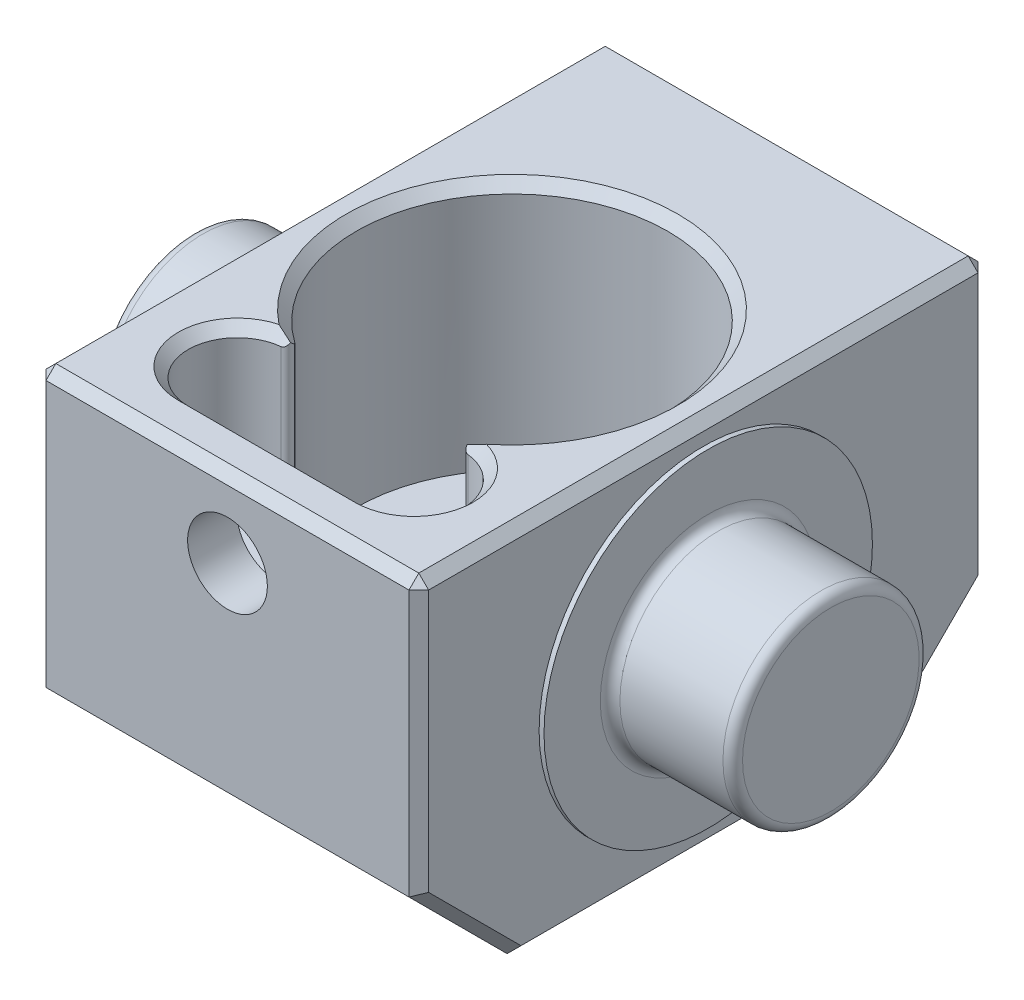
ISO-10303-21;
HEADER;
FILE_DESCRIPTION(('STEP AP214'),'2;1');
FILE_NAME('part.step','',(''),(''),'','','');
FILE_SCHEMA(('AUTOMOTIVE_DESIGN { 1 0 10303 214 1 1 1 1 }'));
ENDSEC;
DATA;
#1=APPLICATION_CONTEXT('core data for automotive mechanical design processes');
#2=APPLICATION_PROTOCOL_DEFINITION('international standard','automotive_design',2000,#1);
#3=PRODUCT_CONTEXT('',#1,'mechanical');
#4=PRODUCT('Part','Part','',(#3));
#5=PRODUCT_RELATED_PRODUCT_CATEGORY('part','',(#4));
#6=PRODUCT_DEFINITION_FORMATION('','',#4);
#7=PRODUCT_DEFINITION_CONTEXT('part definition',#1,'design');
#8=PRODUCT_DEFINITION('design','',#6,#7);
#9=PRODUCT_DEFINITION_SHAPE('','',#8);
#10=(LENGTH_UNIT() NAMED_UNIT(*) SI_UNIT(.MILLI.,.METRE.));
#11=(NAMED_UNIT(*) PLANE_ANGLE_UNIT() SI_UNIT($,.RADIAN.));
#12=(NAMED_UNIT(*) SI_UNIT($,.STERADIAN.) SOLID_ANGLE_UNIT());
#13=UNCERTAINTY_MEASURE_WITH_UNIT(LENGTH_MEASURE(1.E-05),#10,'distance_accuracy_value','');
#14=(GEOMETRIC_REPRESENTATION_CONTEXT(3) GLOBAL_UNCERTAINTY_ASSIGNED_CONTEXT((#13)) GLOBAL_UNIT_ASSIGNED_CONTEXT((#10,
#11,#12)) REPRESENTATION_CONTEXT('',''));
#15=CARTESIAN_POINT('',(0.,0.,0.));
#16=DIRECTION('',(0.,0.,1.));
#17=DIRECTION('',(1.,0.,0.));
#18=AXIS2_PLACEMENT_3D('',#15,#16,#17);
#19=CARTESIAN_POINT('',(-9.75,0.,0.));
#20=DIRECTION('',(1.,0.,0.));
#21=DIRECTION('',(0.,0.,-1.));
#22=AXIS2_PLACEMENT_3D('',#19,#20,#21);
#23=PLANE('',#22);
#24=DIRECTION('',(0.,0.707106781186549,0.707106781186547));
#25=VECTOR('',#24,1.);
#26=CARTESIAN_POINT('',(-9.75,-4.17144660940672,14.1464466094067));
#27=LINE('',#26,#25);
#28=CARTESIAN_POINT('',(-9.75,-9.025,9.29289321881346));
#29=VERTEX_POINT('',#28);
#30=CARTESIAN_POINT('',(-9.75,-4.31789321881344,14.));
#31=VERTEX_POINT('',#30);
#32=EDGE_CURVE('E301',#29,#31,#27,.T.);
#33=ORIENTED_EDGE('',*,*,#32,.T.);
#34=DIRECTION('',(0.,1.,0.));
#35=VECTOR('',#34,1.);
#36=CARTESIAN_POINT('',(-9.75,0.,14.));
#37=LINE('',#36,#35);
#38=CARTESIAN_POINT('',(-9.75,9.025,14.));
#39=VERTEX_POINT('',#38);
#40=EDGE_CURVE('E303',#31,#39,#37,.T.);
#41=ORIENTED_EDGE('',*,*,#40,.T.);
#42=DIRECTION('',(0.,0.,-1.));
#43=VECTOR('',#42,1.);
#44=CARTESIAN_POINT('',(-9.75,9.025,0.));
#45=LINE('',#44,#43);
#46=CARTESIAN_POINT('',(-9.75,9.025,-14.));
#47=VERTEX_POINT('',#46);
#48=EDGE_CURVE('E293',#39,#47,#45,.T.);
#49=ORIENTED_EDGE('',*,*,#48,.T.);
#50=DIRECTION('',(0.,-1.,0.));
#51=VECTOR('',#50,1.);
#52=CARTESIAN_POINT('',(-9.75,0.,-14.));
#53=LINE('',#52,#51);
#54=CARTESIAN_POINT('',(-9.75,-4.31789321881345,-14.));
#55=VERTEX_POINT('',#54);
#56=EDGE_CURVE('E295',#47,#55,#53,.T.);
#57=ORIENTED_EDGE('',*,*,#56,.T.);
#58=DIRECTION('',(0.,-0.707106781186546,0.707106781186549));
#59=VECTOR('',#58,1.);
#60=CARTESIAN_POINT('',(-9.75,-9.17144660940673,-9.14644660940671));
#61=LINE('',#60,#59);
#62=CARTESIAN_POINT('',(-9.75,-9.025,-9.29289321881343));
#63=VERTEX_POINT('',#62);
#64=EDGE_CURVE('E297',#55,#63,#61,.T.);
#65=ORIENTED_EDGE('',*,*,#64,.T.);
#66=DIRECTION('',(0.,0.,1.));
#67=VECTOR('',#66,1.);
#68=CARTESIAN_POINT('',(-9.75,-9.025,0.));
#69=LINE('',#68,#67);
#70=EDGE_CURVE('E299',#63,#29,#69,.T.);
#71=ORIENTED_EDGE('',*,*,#70,.T.);
#72=EDGE_LOOP('',(#33,#41,#49,#57,#65,#71));
#73=FACE_BOUND('',#72,.T.);
#74=CARTESIAN_POINT('',(-9.75,0.,0.));
#75=DIRECTION('',(1.,0.,0.));
#76=DIRECTION('',(0.,0.,-1.));
#77=AXIS2_PLACEMENT_3D('',#74,#75,#76);
#78=CIRCLE('',#77,8.3693);
#79=CARTESIAN_POINT('',(-9.75,0.,-8.3693));
#80=VERTEX_POINT('',#79);
#81=EDGE_CURVE('E238',#80,#80,#78,.F.);
#82=ORIENTED_EDGE('',*,*,#81,.F.);
#83=EDGE_LOOP('',(#82));
#84=FACE_BOUND('',#83,.T.);
#85=ADVANCED_FACE('F32',(#73,#84),#23,.F.);
#86=CARTESIAN_POINT('',(9.75,0.,0.));
#87=DIRECTION('',(1.,0.,0.));
#88=DIRECTION('',(0.,0.,-1.));
#89=AXIS2_PLACEMENT_3D('',#86,#87,#88);
#90=PLANE('',#89);
#91=DIRECTION('',(0.,-1.,0.));
#92=VECTOR('',#91,1.);
#93=CARTESIAN_POINT('',(9.75,-4.52499999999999,14.));
#94=LINE('',#93,#92);
#95=CARTESIAN_POINT('',(9.75,9.025,14.));
#96=VERTEX_POINT('',#95);
#97=CARTESIAN_POINT('',(9.75,-4.31789321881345,14.));
#98=VERTEX_POINT('',#97);
#99=EDGE_CURVE('E263',#96,#98,#94,.T.);
#100=ORIENTED_EDGE('',*,*,#99,.T.);
#101=DIRECTION('',(0.,-0.707106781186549,-0.707106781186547));
#102=VECTOR('',#101,1.);
#103=CARTESIAN_POINT('',(9.75,-9.15894660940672,9.15894660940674));
#104=LINE('',#103,#102);
#105=CARTESIAN_POINT('',(9.75,-9.025,9.29289321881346));
#106=VERTEX_POINT('',#105);
#107=EDGE_CURVE('E265',#98,#106,#104,.T.);
#108=ORIENTED_EDGE('',*,*,#107,.T.);
#109=DIRECTION('',(0.,0.,-1.));
#110=VECTOR('',#109,1.);
#111=CARTESIAN_POINT('',(9.75,-9.025,-9.49999999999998));
#112=LINE('',#111,#110);
#113=CARTESIAN_POINT('',(9.75,-9.025,-9.29289321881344));
#114=VERTEX_POINT('',#113);
#115=EDGE_CURVE('E261',#106,#114,#112,.T.);
#116=ORIENTED_EDGE('',*,*,#115,.T.);
#117=DIRECTION('',(0.,0.707106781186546,-0.707106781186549));
#118=VECTOR('',#117,1.);
#119=CARTESIAN_POINT('',(9.75,-9.15894660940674,-9.1589466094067));
#120=LINE('',#119,#118);
#121=CARTESIAN_POINT('',(9.75,-4.31789321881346,-14.));
#122=VERTEX_POINT('',#121);
#123=EDGE_CURVE('E259',#114,#122,#120,.T.);
#124=ORIENTED_EDGE('',*,*,#123,.T.);
#125=DIRECTION('',(0.,1.,0.));
#126=VECTOR('',#125,1.);
#127=CARTESIAN_POINT('',(9.75,9.525,-14.));
#128=LINE('',#127,#126);
#129=CARTESIAN_POINT('',(9.75,9.025,-14.));
#130=VERTEX_POINT('',#129);
#131=EDGE_CURVE('E257',#122,#130,#128,.T.);
#132=ORIENTED_EDGE('',*,*,#131,.T.);
#133=DIRECTION('',(0.,0.,1.));
#134=VECTOR('',#133,1.);
#135=CARTESIAN_POINT('',(9.75,9.025,14.5));
#136=LINE('',#135,#134);
#137=EDGE_CURVE('E255',#130,#96,#136,.T.);
#138=ORIENTED_EDGE('',*,*,#137,.T.);
#139=EDGE_LOOP('',(#100,#108,#116,#124,#132,#138));
#140=FACE_BOUND('',#139,.T.);
#141=CARTESIAN_POINT('',(9.75,0.,0.));
#142=DIRECTION('',(-1.,0.,0.));
#143=DIRECTION('',(0.,0.,1.));
#144=AXIS2_PLACEMENT_3D('',#141,#142,#143);
#145=CIRCLE('',#144,8.3693);
#146=CARTESIAN_POINT('',(9.75,0.,8.3693));
#147=VERTEX_POINT('',#146);
#148=EDGE_CURVE('E235',#147,#147,#145,.T.);
#149=ORIENTED_EDGE('',*,*,#148,.T.);
#150=EDGE_LOOP('',(#149));
#151=FACE_BOUND('',#150,.T.);
#152=ADVANCED_FACE('F486',(#140,#151),#90,.T.);
#153=CARTESIAN_POINT('',(9.75,9.525,-14.5));
#154=DIRECTION('',(0.,0.,1.));
#155=DIRECTION('',(0.,-1.,0.));
#156=AXIS2_PLACEMENT_3D('',#153,#154,#155);
#157=PLANE('',#156);
#158=DIRECTION('',(1.,0.,0.));
#159=VECTOR('',#158,1.);
#160=CARTESIAN_POINT('',(9.75,9.025,-14.5));
#161=LINE('',#160,#159);
#162=CARTESIAN_POINT('',(-9.25,9.025,-14.5));
#163=VERTEX_POINT('',#162);
#164=CARTESIAN_POINT('',(9.25,9.025,-14.5));
#165=VERTEX_POINT('',#164);
#166=EDGE_CURVE('E287',#163,#165,#161,.T.);
#167=ORIENTED_EDGE('',*,*,#166,.T.);
#168=DIRECTION('',(0.,-1.,0.));
#169=VECTOR('',#168,1.);
#170=CARTESIAN_POINT('',(9.25,-4.525,-14.5));
#171=LINE('',#170,#169);
#172=CARTESIAN_POINT('',(9.25,-4.525,-14.5));
#173=VERTEX_POINT('',#172);
#174=EDGE_CURVE('E291',#165,#173,#171,.T.);
#175=ORIENTED_EDGE('',*,*,#174,.T.);
#176=DIRECTION('',(-1.,0.,0.));
#177=VECTOR('',#176,1.);
#178=CARTESIAN_POINT('',(9.75,-4.525,-14.5));
#179=LINE('',#178,#177);
#180=CARTESIAN_POINT('',(-9.25,-4.525,-14.5));
#181=VERTEX_POINT('',#180);
#182=EDGE_CURVE('E243',#173,#181,#179,.T.);
#183=ORIENTED_EDGE('',*,*,#182,.T.);
#184=DIRECTION('',(0.,1.,0.));
#185=VECTOR('',#184,1.);
#186=CARTESIAN_POINT('',(-9.25,9.525,-14.5));
#187=LINE('',#186,#185);
#188=EDGE_CURVE('E289',#181,#163,#187,.T.);
#189=ORIENTED_EDGE('',*,*,#188,.T.);
#190=EDGE_LOOP('',(#167,#175,#183,#189));
#191=FACE_BOUND('',#190,.T.);
#192=ADVANCED_FACE('F492',(#191),#157,.F.);
#193=CARTESIAN_POINT('',(9.75,9.525,14.5));
#194=DIRECTION('',(0.,-1.,0.));
#195=DIRECTION('',(0.,0.,-1.));
#196=AXIS2_PLACEMENT_3D('',#193,#194,#195);
#197=PLANE('',#196);
#198=CARTESIAN_POINT('',(4.5,9.525,9.49579));
#199=DIRECTION('',(0.,-1.,0.));
#200=DIRECTION('',(0.,0.,-1.));
#201=AXIS2_PLACEMENT_3D('',#198,#199,#200);
#202=CIRCLE('',#201,3.00990000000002);
#203=CARTESIAN_POINT('',(5.28717407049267,9.525,6.59064714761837));
#204=VERTEX_POINT('',#203);
#205=CARTESIAN_POINT('',(4.5,9.525,12.50569));
#206=VERTEX_POINT('',#205);
#207=EDGE_CURVE('E378',#204,#206,#202,.T.);
#208=ORIENTED_EDGE('',*,*,#207,.T.);
#209=DIRECTION('',(-1.,0.,0.));
#210=VECTOR('',#209,1.);
#211=CARTESIAN_POINT('',(9.75,9.525,12.50569));
#212=LINE('',#211,#210);
#213=CARTESIAN_POINT('',(-4.5,9.525,12.50569));
#214=VERTEX_POINT('',#213);
#215=EDGE_CURVE('E380',#206,#214,#212,.T.);
#216=ORIENTED_EDGE('',*,*,#215,.T.);
#217=CARTESIAN_POINT('',(-4.5,9.525,9.49579));
#218=DIRECTION('',(0.,-1.,0.));
#219=DIRECTION('',(0.,0.,-1.));
#220=AXIS2_PLACEMENT_3D('',#217,#218,#219);
#221=CIRCLE('',#220,3.00990000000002);
#222=CARTESIAN_POINT('',(-5.28717407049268,9.525,6.59064714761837));
#223=VERTEX_POINT('',#222);
#224=EDGE_CURVE('E374',#214,#223,#221,.T.);
#225=ORIENTED_EDGE('',*,*,#224,.T.);
#226=CARTESIAN_POINT('',(0.,9.525,0.));
#227=DIRECTION('',(0.,-1.,0.));
#228=DIRECTION('',(0.,0.,-1.));
#229=AXIS2_PLACEMENT_3D('',#226,#227,#228);
#230=CIRCLE('',#229,8.44931000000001);
#231=EDGE_CURVE('E376',#223,#204,#230,.T.);
#232=ORIENTED_EDGE('',*,*,#231,.T.);
#233=EDGE_LOOP('',(#208,#216,#225,#232));
#234=FACE_BOUND('',#233,.T.);
#235=DIRECTION('',(0.,0.,-1.));
#236=VECTOR('',#235,1.);
#237=CARTESIAN_POINT('',(9.25,9.525,-14.5));
#238=LINE('',#237,#236);
#239=CARTESIAN_POINT('',(9.25,9.525,14.));
#240=VERTEX_POINT('',#239);
#241=CARTESIAN_POINT('',(9.25,9.525,-14.));
#242=VERTEX_POINT('',#241);
#243=EDGE_CURVE('E310',#240,#242,#238,.T.);
#244=ORIENTED_EDGE('',*,*,#243,.T.);
#245=DIRECTION('',(-1.,0.,0.));
#246=VECTOR('',#245,1.);
#247=CARTESIAN_POINT('',(9.75,9.525,-14.));
#248=LINE('',#247,#246);
#249=CARTESIAN_POINT('',(-9.25,9.525,-14.));
#250=VERTEX_POINT('',#249);
#251=EDGE_CURVE('E312',#242,#250,#248,.T.);
#252=ORIENTED_EDGE('',*,*,#251,.T.);
#253=DIRECTION('',(0.,0.,1.));
#254=VECTOR('',#253,1.);
#255=CARTESIAN_POINT('',(-9.25,9.525,14.5));
#256=LINE('',#255,#254);
#257=CARTESIAN_POINT('',(-9.25,9.525,14.));
#258=VERTEX_POINT('',#257);
#259=EDGE_CURVE('E306',#250,#258,#256,.T.);
#260=ORIENTED_EDGE('',*,*,#259,.T.);
#261=DIRECTION('',(1.,0.,0.));
#262=VECTOR('',#261,1.);
#263=CARTESIAN_POINT('',(9.75,9.525,14.));
#264=LINE('',#263,#262);
#265=EDGE_CURVE('E308',#258,#240,#264,.T.);
#266=ORIENTED_EDGE('',*,*,#265,.T.);
#267=EDGE_LOOP('',(#244,#252,#260,#266));
#268=FACE_BOUND('',#267,.T.);
#269=ADVANCED_FACE('F506',(#234,#268),#197,.F.);
#270=CARTESIAN_POINT('',(9.75,9.525,14.5));
#271=DIRECTION('',(0.,0.,-1.));
#272=DIRECTION('',(0.,1.,0.));
#273=AXIS2_PLACEMENT_3D('',#270,#271,#272);
#274=PLANE('',#273);
#275=CARTESIAN_POINT('',(0.,5.585,14.5));
#276=DIRECTION('',(0.,0.,1.));
#277=DIRECTION('',(1.,0.,0.));
#278=AXIS2_PLACEMENT_3D('',#275,#276,#277);
#279=CIRCLE('',#278,2.032);
#280=CARTESIAN_POINT('',(2.032,5.585,14.5));
#281=VERTEX_POINT('',#280);
#282=EDGE_CURVE('E394',#281,#281,#279,.T.);
#283=ORIENTED_EDGE('',*,*,#282,.F.);
#284=EDGE_LOOP('',(#283));
#285=FACE_BOUND('',#284,.T.);
#286=DIRECTION('',(1.,0.,0.));
#287=VECTOR('',#286,1.);
#288=CARTESIAN_POINT('',(9.75,-4.52499999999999,14.5));
#289=LINE('',#288,#287);
#290=CARTESIAN_POINT('',(-9.25,-4.52499999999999,14.5));
#291=VERTEX_POINT('',#290);
#292=CARTESIAN_POINT('',(9.25,-4.52499999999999,14.5));
#293=VERTEX_POINT('',#292);
#294=EDGE_CURVE('E252',#291,#293,#289,.T.);
#295=ORIENTED_EDGE('',*,*,#294,.T.);
#296=DIRECTION('',(0.,1.,0.));
#297=VECTOR('',#296,1.);
#298=CARTESIAN_POINT('',(9.25,9.525,14.5));
#299=LINE('',#298,#297);
#300=CARTESIAN_POINT('',(9.25,9.025,14.5));
#301=VERTEX_POINT('',#300);
#302=EDGE_CURVE('E277',#293,#301,#299,.T.);
#303=ORIENTED_EDGE('',*,*,#302,.T.);
#304=DIRECTION('',(-1.,0.,0.));
#305=VECTOR('',#304,1.);
#306=CARTESIAN_POINT('',(9.75,9.025,14.5));
#307=LINE('',#306,#305);
#308=CARTESIAN_POINT('',(-9.25,9.025,14.5));
#309=VERTEX_POINT('',#308);
#310=EDGE_CURVE('E273',#301,#309,#307,.T.);
#311=ORIENTED_EDGE('',*,*,#310,.T.);
#312=DIRECTION('',(0.,-1.,0.));
#313=VECTOR('',#312,1.);
#314=CARTESIAN_POINT('',(-9.25,9.525,14.5));
#315=LINE('',#314,#313);
#316=EDGE_CURVE('E275',#309,#291,#315,.T.);
#317=ORIENTED_EDGE('',*,*,#316,.T.);
#318=EDGE_LOOP('',(#295,#303,#311,#317));
#319=FACE_BOUND('',#318,.T.);
#320=ADVANCED_FACE('F502',(#285,#319),#274,.F.);
#321=CARTESIAN_POINT('',(9.75,-9.525,14.5));
#322=DIRECTION('',(0.,1.,0.));
#323=DIRECTION('',(0.,0.,1.));
#324=AXIS2_PLACEMENT_3D('',#321,#322,#323);
#325=PLANE('',#324);
#326=CARTESIAN_POINT('',(0.,-9.525,0.));
#327=DIRECTION('',(0.,1.,0.));
#328=DIRECTION('',(0.,0.,1.));
#329=AXIS2_PLACEMENT_3D('',#326,#327,#328);
#330=CIRCLE('',#329,4.86879999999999);
#331=CARTESIAN_POINT('',(0.,-9.525,4.86879999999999));
#332=VERTEX_POINT('',#331);
#333=EDGE_CURVE('E627',#332,#332,#330,.T.);
#334=ORIENTED_EDGE('',*,*,#333,.T.);
#335=EDGE_LOOP('',(#334));
#336=FACE_BOUND('',#335,.T.);
#337=DIRECTION('',(1.,0.,0.));
#338=VECTOR('',#337,1.);
#339=CARTESIAN_POINT('',(9.75,-9.525,-9.49999999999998));
#340=LINE('',#339,#338);
#341=CARTESIAN_POINT('',(-9.25,-9.525,-9.49999999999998));
#342=VERTEX_POINT('',#341);
#343=CARTESIAN_POINT('',(9.25,-9.525,-9.49999999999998));
#344=VERTEX_POINT('',#343);
#345=EDGE_CURVE('E249',#342,#344,#340,.T.);
#346=ORIENTED_EDGE('',*,*,#345,.T.);
#347=DIRECTION('',(0.,0.,1.));
#348=VECTOR('',#347,1.);
#349=CARTESIAN_POINT('',(9.25,-9.525,9.50000000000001));
#350=LINE('',#349,#348);
#351=CARTESIAN_POINT('',(9.25,-9.525,9.50000000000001));
#352=VERTEX_POINT('',#351);
#353=EDGE_CURVE('E281',#344,#352,#350,.T.);
#354=ORIENTED_EDGE('',*,*,#353,.T.);
#355=DIRECTION('',(-1.,0.,0.));
#356=VECTOR('',#355,1.);
#357=CARTESIAN_POINT('',(9.75,-9.525,9.50000000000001));
#358=LINE('',#357,#356);
#359=CARTESIAN_POINT('',(-9.25,-9.525,9.50000000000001));
#360=VERTEX_POINT('',#359);
#361=EDGE_CURVE('E246',#352,#360,#358,.T.);
#362=ORIENTED_EDGE('',*,*,#361,.T.);
#363=DIRECTION('',(0.,0.,-1.));
#364=VECTOR('',#363,1.);
#365=CARTESIAN_POINT('',(-9.25,-9.525,14.5));
#366=LINE('',#365,#364);
#367=EDGE_CURVE('E279',#360,#342,#366,.T.);
#368=ORIENTED_EDGE('',*,*,#367,.T.);
#369=EDGE_LOOP('',(#346,#354,#362,#368));
#370=FACE_BOUND('',#369,.T.);
#371=ADVANCED_FACE('F498',(#336,#370),#325,.F.);
#372=CARTESIAN_POINT('',(0.,0.,0.));
#373=DIRECTION('',(-1.,0.,0.));
#374=DIRECTION('',(0.,0.,1.));
#375=AXIS2_PLACEMENT_3D('',#372,#373,#374);
#376=CYLINDRICAL_SURFACE('',#375,8.3693);
#377=ORIENTED_EDGE('',*,*,#148,.F.);
#378=EDGE_LOOP('',(#377));
#379=FACE_BOUND('',#378,.T.);
#380=CARTESIAN_POINT('',(10.,0.,0.));
#381=DIRECTION('',(-1.,0.,0.));
#382=DIRECTION('',(0.,0.,1.));
#383=AXIS2_PLACEMENT_3D('',#380,#381,#382);
#384=CIRCLE('',#383,8.3693);
#385=CARTESIAN_POINT('',(10.,0.,8.3693));
#386=VERTEX_POINT('',#385);
#387=EDGE_CURVE('E232',#386,#386,#384,.T.);
#388=ORIENTED_EDGE('',*,*,#387,.T.);
#389=EDGE_LOOP('',(#388));
#390=FACE_BOUND('',#389,.T.);
#391=ADVANCED_FACE('F501',(#379,#390),#376,.T.);
#392=CARTESIAN_POINT('',(10.,8.3693,0.));
#393=DIRECTION('',(-1.,0.,0.));
#394=DIRECTION('',(0.,0.,1.));
#395=AXIS2_PLACEMENT_3D('',#392,#393,#394);
#396=PLANE('',#395);
#397=CARTESIAN_POINT('',(10.,0.,0.));
#398=DIRECTION('',(-1.,0.,0.));
#399=DIRECTION('',(0.,0.,1.));
#400=AXIS2_PLACEMENT_3D('',#397,#398,#399);
#401=CIRCLE('',#400,5.500000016);
#402=CARTESIAN_POINT('',(10.,0.,5.500000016));
#403=VERTEX_POINT('',#402);
#404=EDGE_CURVE('E642',#403,#403,#401,.T.);
#405=ORIENTED_EDGE('',*,*,#404,.T.);
#406=EDGE_LOOP('',(#405));
#407=FACE_BOUND('',#406,.T.);
#408=ORIENTED_EDGE('',*,*,#387,.F.);
#409=EDGE_LOOP('',(#408));
#410=FACE_BOUND('',#409,.T.);
#411=ADVANCED_FACE('F688',(#407,#410),#396,.F.);
#412=CARTESIAN_POINT('',(0.,0.,0.));
#413=DIRECTION('',(-1.,0.,0.));
#414=DIRECTION('',(0.,0.,1.));
#415=AXIS2_PLACEMENT_3D('',#412,#413,#414);
#416=CYLINDRICAL_SURFACE('',#415,5.);
#417=CARTESIAN_POINT('',(10.500000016,0.,0.));
#418=DIRECTION('',(-1.,0.,0.));
#419=DIRECTION('',(0.,0.,1.));
#420=AXIS2_PLACEMENT_3D('',#417,#418,#419);
#421=CIRCLE('',#420,5.);
#422=CARTESIAN_POINT('',(10.500000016,0.,5.));
#423=VERTEX_POINT('',#422);
#424=EDGE_CURVE('E645',#423,#423,#421,.F.);
#425=ORIENTED_EDGE('',*,*,#424,.T.);
#426=EDGE_LOOP('',(#425));
#427=FACE_BOUND('',#426,.T.);
#428=CARTESIAN_POINT('',(15.749999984,0.,0.));
#429=DIRECTION('',(-1.,0.,0.));
#430=DIRECTION('',(0.,0.,1.));
#431=AXIS2_PLACEMENT_3D('',#428,#429,#430);
#432=CIRCLE('',#431,5.);
#433=CARTESIAN_POINT('',(15.749999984,0.,5.));
#434=VERTEX_POINT('',#433);
#435=EDGE_CURVE('E636',#434,#434,#432,.T.);
#436=ORIENTED_EDGE('',*,*,#435,.T.);
#437=EDGE_LOOP('',(#436));
#438=FACE_BOUND('',#437,.T.);
#439=ADVANCED_FACE('F681',(#427,#438),#416,.T.);
#440=CARTESIAN_POINT('',(16.25,5.,0.));
#441=DIRECTION('',(-1.,0.,0.));
#442=DIRECTION('',(0.,0.,1.));
#443=AXIS2_PLACEMENT_3D('',#440,#441,#442);
#444=PLANE('',#443);
#445=CARTESIAN_POINT('',(16.25,0.,0.));
#446=DIRECTION('',(-1.,0.,0.));
#447=DIRECTION('',(0.,0.,1.));
#448=AXIS2_PLACEMENT_3D('',#445,#446,#447);
#449=CIRCLE('',#448,4.499999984);
#450=CARTESIAN_POINT('',(16.25,0.,4.499999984));
#451=VERTEX_POINT('',#450);
#452=EDGE_CURVE('E639',#451,#451,#449,.F.);
#453=ORIENTED_EDGE('',*,*,#452,.T.);
#454=EDGE_LOOP('',(#453));
#455=FACE_BOUND('',#454,.T.);
#456=ADVANCED_FACE('F675',(#455),#444,.F.);
#457=CARTESIAN_POINT('',(0.,0.,0.));
#458=DIRECTION('',(1.,0.,0.));
#459=DIRECTION('',(0.,0.,1.));
#460=AXIS2_PLACEMENT_3D('',#457,#458,#459);
#461=CYLINDRICAL_SURFACE('',#460,8.3693);
#462=ORIENTED_EDGE('',*,*,#81,.T.);
#463=EDGE_LOOP('',(#462));
#464=FACE_BOUND('',#463,.T.);
#465=CARTESIAN_POINT('',(-10.,0.,0.));
#466=DIRECTION('',(-1.,0.,0.));
#467=DIRECTION('',(0.,0.,1.));
#468=AXIS2_PLACEMENT_3D('',#465,#466,#467);
#469=CIRCLE('',#468,8.3693);
#470=CARTESIAN_POINT('',(-10.,0.,8.3693));
#471=VERTEX_POINT('',#470);
#472=EDGE_CURVE('E229',#471,#471,#469,.T.);
#473=ORIENTED_EDGE('',*,*,#472,.F.);
#474=EDGE_LOOP('',(#473));
#475=FACE_BOUND('',#474,.T.);
#476=ADVANCED_FACE('F670',(#464,#475),#461,.T.);
#477=CARTESIAN_POINT('',(-10.,8.3693,0.));
#478=DIRECTION('',(1.,0.,0.));
#479=DIRECTION('',(0.,0.,1.));
#480=AXIS2_PLACEMENT_3D('',#477,#478,#479);
#481=PLANE('',#480);
#482=CARTESIAN_POINT('',(-10.,0.,0.));
#483=DIRECTION('',(1.,0.,0.));
#484=DIRECTION('',(0.,0.,-1.));
#485=AXIS2_PLACEMENT_3D('',#482,#483,#484);
#486=CIRCLE('',#485,5.500000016);
#487=CARTESIAN_POINT('',(-10.,0.,-5.500000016));
#488=VERTEX_POINT('',#487);
#489=EDGE_CURVE('E11',#488,#488,#486,.T.);
#490=ORIENTED_EDGE('',*,*,#489,.T.);
#491=EDGE_LOOP('',(#490));
#492=FACE_BOUND('',#491,.T.);
#493=ORIENTED_EDGE('',*,*,#472,.T.);
#494=EDGE_LOOP('',(#493));
#495=FACE_BOUND('',#494,.T.);
#496=ADVANCED_FACE('F667',(#492,#495),#481,.F.);
#497=CARTESIAN_POINT('',(0.,0.,0.));
#498=DIRECTION('',(1.,0.,0.));
#499=DIRECTION('',(0.,0.,1.));
#500=AXIS2_PLACEMENT_3D('',#497,#498,#499);
#501=CYLINDRICAL_SURFACE('',#500,5.);
#502=CARTESIAN_POINT('',(-10.500000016,0.,0.));
#503=DIRECTION('',(1.,0.,0.));
#504=DIRECTION('',(0.,0.,-1.));
#505=AXIS2_PLACEMENT_3D('',#502,#503,#504);
#506=CIRCLE('',#505,5.);
#507=CARTESIAN_POINT('',(-10.500000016,0.,-5.));
#508=VERTEX_POINT('',#507);
#509=EDGE_CURVE('E40',#508,#508,#506,.F.);
#510=ORIENTED_EDGE('',*,*,#509,.T.);
#511=EDGE_LOOP('',(#510));
#512=FACE_BOUND('',#511,.T.);
#513=CARTESIAN_POINT('',(-15.749999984,0.,0.));
#514=DIRECTION('',(1.,0.,0.));
#515=DIRECTION('',(0.,0.,-1.));
#516=AXIS2_PLACEMENT_3D('',#513,#514,#515);
#517=CIRCLE('',#516,5.);
#518=CARTESIAN_POINT('',(-15.749999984,0.,-5.));
#519=VERTEX_POINT('',#518);
#520=EDGE_CURVE('E633',#519,#519,#517,.T.);
#521=ORIENTED_EDGE('',*,*,#520,.T.);
#522=EDGE_LOOP('',(#521));
#523=FACE_BOUND('',#522,.T.);
#524=ADVANCED_FACE('F650',(#512,#523),#501,.T.);
#525=CARTESIAN_POINT('',(-16.25,5.,0.));
#526=DIRECTION('',(1.,0.,0.));
#527=DIRECTION('',(0.,0.,1.));
#528=AXIS2_PLACEMENT_3D('',#525,#526,#527);
#529=PLANE('',#528);
#530=CARTESIAN_POINT('',(-16.25,0.,0.));
#531=DIRECTION('',(1.,0.,0.));
#532=DIRECTION('',(0.,0.,-1.));
#533=AXIS2_PLACEMENT_3D('',#530,#531,#532);
#534=CIRCLE('',#533,4.499999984);
#535=CARTESIAN_POINT('',(-16.25,0.,-4.499999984));
#536=VERTEX_POINT('',#535);
#537=EDGE_CURVE('E630',#536,#536,#534,.F.);
#538=ORIENTED_EDGE('',*,*,#537,.T.);
#539=EDGE_LOOP('',(#538));
#540=FACE_BOUND('',#539,.T.);
#541=ADVANCED_FACE('F729',(#540),#529,.F.);
#542=CARTESIAN_POINT('',(0.,-3.175,0.));
#543=DIRECTION('',(0.,-1.,0.));
#544=DIRECTION('',(0.,0.,-1.));
#545=AXIS2_PLACEMENT_3D('',#542,#543,#544);
#546=PLANE('',#545);
#547=CARTESIAN_POINT('',(0.,-3.175,0.));
#548=DIRECTION('',(0.,-1.,0.));
#549=DIRECTION('',(0.,0.,-1.));
#550=AXIS2_PLACEMENT_3D('',#547,#548,#549);
#551=CIRCLE('',#550,4.86879999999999);
#552=CARTESIAN_POINT('',(0.,-3.175,-4.86879999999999));
#553=VERTEX_POINT('',#552);
#554=EDGE_CURVE('E624',#553,#553,#551,.T.);
#555=ORIENTED_EDGE('',*,*,#554,.T.);
#556=EDGE_LOOP('',(#555));
#557=FACE_BOUND('',#556,.T.);
#558=CARTESIAN_POINT('',(0.,-3.175,0.));
#559=DIRECTION('',(0.,1.,0.));
#560=DIRECTION('',(0.,0.,1.));
#561=AXIS2_PLACEMENT_3D('',#558,#559,#560);
#562=CIRCLE('',#561,7.94131);
#563=CARTESIAN_POINT('',(0.,-3.175,7.94131));
#564=VERTEX_POINT('',#563);
#565=EDGE_CURVE('E225',#564,#564,#562,.T.);
#566=ORIENTED_EDGE('',*,*,#565,.T.);
#567=EDGE_LOOP('',(#566));
#568=FACE_BOUND('',#567,.T.);
#569=ADVANCED_FACE('F734',(#557,#568),#546,.F.);
#570=CARTESIAN_POINT('',(0.,10.1246822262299,0.));
#571=DIRECTION('',(0.,1.,0.));
#572=DIRECTION('',(0.,0.,1.));
#573=AXIS2_PLACEMENT_3D('',#570,#571,#572);
#574=CYLINDRICAL_SURFACE('',#573,7.94131);
#575=CARTESIAN_POINT('',(0.,3.025,0.));
#576=DIRECTION('',(0.,1.,0.));
#577=DIRECTION('',(0.,0.,1.));
#578=AXIS2_PLACEMENT_3D('',#575,#576,#577);
#579=CIRCLE('',#578,7.94131);
#580=CARTESIAN_POINT('',(4.61257995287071,3.025,6.46440335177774));
#581=VERTEX_POINT('',#580);
#582=CARTESIAN_POINT('',(-4.61257995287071,3.025,6.46440335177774));
#583=VERTEX_POINT('',#582);
#584=EDGE_CURVE('E241',#581,#583,#579,.F.);
#585=ORIENTED_EDGE('',*,*,#584,.F.);
#586=DIRECTION('',(0.,1.,0.));
#587=VECTOR('',#586,1.);
#588=CARTESIAN_POINT('',(4.61257995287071,10.1246822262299,6.46440335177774));
#589=LINE('',#588,#587);
#590=CARTESIAN_POINT('',(4.61257995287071,9.01699999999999,6.46440335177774));
#591=VERTEX_POINT('',#590);
#592=EDGE_CURVE('E453',#581,#591,#589,.T.);
#593=ORIENTED_EDGE('',*,*,#592,.T.);
#594=CARTESIAN_POINT('',(0.,9.01699999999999,0.));
#595=DIRECTION('',(0.,-1.,0.));
#596=DIRECTION('',(0.,0.,-1.));
#597=AXIS2_PLACEMENT_3D('',#594,#595,#596);
#598=CIRCLE('',#597,7.94131);
#599=CARTESIAN_POINT('',(-4.61257995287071,9.01699999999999,6.46440335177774));
#600=VERTEX_POINT('',#599);
#601=EDGE_CURVE('E386',#591,#600,#598,.F.);
#602=ORIENTED_EDGE('',*,*,#601,.T.);
#603=DIRECTION('',(0.,1.,0.));
#604=VECTOR('',#603,1.);
#605=CARTESIAN_POINT('',(-4.61257995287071,10.1246822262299,6.46440335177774));
#606=LINE('',#605,#604);
#607=EDGE_CURVE('E390',#600,#583,#606,.F.);
#608=ORIENTED_EDGE('',*,*,#607,.T.);
#609=EDGE_LOOP('',(#585,#593,#602,#608));
#610=FACE_BOUND('',#609,.T.);
#611=ORIENTED_EDGE('',*,*,#565,.F.);
#612=EDGE_LOOP('',(#611));
#613=FACE_BOUND('',#612,.T.);
#614=ADVANCED_FACE('F898',(#610,#613),#574,.F.);
#615=CARTESIAN_POINT('',(0.,-1.92521317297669,0.));
#616=DIRECTION('',(0.,1.,0.));
#617=DIRECTION('',(0.,0.,1.));
#618=AXIS2_PLACEMENT_3D('',#615,#616,#617);
#619=CYLINDRICAL_SURFACE('',#618,4.3688);
#620=CARTESIAN_POINT('',(0.,-3.67499999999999,0.));
#621=DIRECTION('',(0.,-1.,0.));
#622=DIRECTION('',(0.,0.,-1.));
#623=AXIS2_PLACEMENT_3D('',#620,#621,#622);
#624=CIRCLE('',#623,4.3688);
#625=CARTESIAN_POINT('',(0.,-3.67499999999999,-4.3688));
#626=VERTEX_POINT('',#625);
#627=EDGE_CURVE('E621',#626,#626,#624,.F.);
#628=ORIENTED_EDGE('',*,*,#627,.T.);
#629=EDGE_LOOP('',(#628));
#630=FACE_BOUND('',#629,.T.);
#631=CARTESIAN_POINT('',(0.,-9.025,0.));
#632=DIRECTION('',(0.,1.,0.));
#633=DIRECTION('',(0.,0.,1.));
#634=AXIS2_PLACEMENT_3D('',#631,#632,#633);
#635=CIRCLE('',#634,4.3688);
#636=CARTESIAN_POINT('',(0.,-9.025,4.3688));
#637=VERTEX_POINT('',#636);
#638=EDGE_CURVE('E614',#637,#637,#635,.F.);
#639=ORIENTED_EDGE('',*,*,#638,.T.);
#640=EDGE_LOOP('',(#639));
#641=FACE_BOUND('',#640,.T.);
#642=ADVANCED_FACE('F903',(#630,#641),#619,.F.);
#643=CARTESIAN_POINT('',(-4.5,3.025,9.49579));
#644=DIRECTION('',(0.,1.,0.));
#645=DIRECTION('',(0.,0.,1.));
#646=AXIS2_PLACEMENT_3D('',#643,#644,#645);
#647=PLANE('',#646);
#648=ORIENTED_EDGE('',*,*,#584,.T.);
#649=CARTESIAN_POINT('',(-4.78683004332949,3.025,6.7086100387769));
#650=DIRECTION('',(0.,1.,0.));
#651=DIRECTION('',(0.,0.,1.));
#652=AXIS2_PLACEMENT_3D('',#649,#650,#651);
#653=CIRCLE('',#652,0.3);
#654=CARTESIAN_POINT('',(-4.7561190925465,3.025,7.00703396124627));
#655=VERTEX_POINT('',#654);
#656=EDGE_CURVE('E55',#583,#655,#653,.F.);
#657=ORIENTED_EDGE('',*,*,#656,.T.);
#658=CARTESIAN_POINT('',(-4.5,3.025,9.49579));
#659=DIRECTION('',(0.,1.,0.));
#660=DIRECTION('',(0.,0.,1.));
#661=AXIS2_PLACEMENT_3D('',#658,#659,#660);
#662=CIRCLE('',#661,2.5019);
#663=CARTESIAN_POINT('',(-4.5,3.025,11.99769));
#664=VERTEX_POINT('',#663);
#665=EDGE_CURVE('E198',#655,#664,#662,.T.);
#666=ORIENTED_EDGE('',*,*,#665,.T.);
#667=DIRECTION('',(1.,0.,0.));
#668=VECTOR('',#667,1.);
#669=CARTESIAN_POINT('',(-4.5,3.025,11.99769));
#670=LINE('',#669,#668);
#671=CARTESIAN_POINT('',(4.5,3.025,11.99769));
#672=VERTEX_POINT('',#671);
#673=EDGE_CURVE('E203',#664,#672,#670,.T.);
#674=ORIENTED_EDGE('',*,*,#673,.T.);
#675=CARTESIAN_POINT('',(4.5,3.025,9.49579));
#676=DIRECTION('',(0.,1.,0.));
#677=DIRECTION('',(0.,0.,1.));
#678=AXIS2_PLACEMENT_3D('',#675,#676,#677);
#679=CIRCLE('',#678,2.5019);
#680=CARTESIAN_POINT('',(4.7561190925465,3.025,7.00703396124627));
#681=VERTEX_POINT('',#680);
#682=EDGE_CURVE('E216',#672,#681,#679,.T.);
#683=ORIENTED_EDGE('',*,*,#682,.T.);
#684=CARTESIAN_POINT('',(4.78683004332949,3.025,6.7086100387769));
#685=DIRECTION('',(0.,1.,0.));
#686=DIRECTION('',(0.,0.,1.));
#687=AXIS2_PLACEMENT_3D('',#684,#685,#686);
#688=CIRCLE('',#687,0.3);
#689=EDGE_CURVE('E610',#681,#581,#688,.F.);
#690=ORIENTED_EDGE('',*,*,#689,.T.);
#691=EDGE_LOOP('',(#648,#657,#666,#674,#683,#690));
#692=FACE_BOUND('',#691,.T.);
#693=ADVANCED_FACE('F200',(#692),#647,.T.);
#694=CARTESIAN_POINT('',(-4.5,3.025,9.49579));
#695=DIRECTION('',(0.,1.,0.));
#696=DIRECTION('',(0.,0.,1.));
#697=AXIS2_PLACEMENT_3D('',#694,#695,#696);
#698=CYLINDRICAL_SURFACE('',#697,2.5019);
#699=ORIENTED_EDGE('',*,*,#665,.F.);
#700=DIRECTION('',(0.,1.,0.));
#701=VECTOR('',#700,1.);
#702=CARTESIAN_POINT('',(-4.7561190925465,3.025,7.00703396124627));
#703=LINE('',#702,#701);
#704=CARTESIAN_POINT('',(-4.7561190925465,9.01699999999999,7.00703396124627));
#705=VERTEX_POINT('',#704);
#706=EDGE_CURVE('E1096',#655,#705,#703,.T.);
#707=ORIENTED_EDGE('',*,*,#706,.T.);
#708=CARTESIAN_POINT('',(-4.5,9.01699999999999,9.49579));
#709=DIRECTION('',(0.,-1.,0.));
#710=DIRECTION('',(0.,0.,-1.));
#711=AXIS2_PLACEMENT_3D('',#708,#709,#710);
#712=CIRCLE('',#711,2.5019);
#713=CARTESIAN_POINT('',(-4.5,9.01699999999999,11.99769));
#714=VERTEX_POINT('',#713);
#715=EDGE_CURVE('E211',#705,#714,#712,.F.);
#716=ORIENTED_EDGE('',*,*,#715,.T.);
#717=DIRECTION('',(0.,1.,0.));
#718=VECTOR('',#717,1.);
#719=CARTESIAN_POINT('',(-4.5,3.025,11.99769));
#720=LINE('',#719,#718);
#721=EDGE_CURVE('E209',#664,#714,#720,.T.);
#722=ORIENTED_EDGE('',*,*,#721,.F.);
#723=EDGE_LOOP('',(#699,#707,#716,#722));
#724=FACE_BOUND('',#723,.T.);
#725=ADVANCED_FACE('F210',(#724),#698,.F.);
#726=CARTESIAN_POINT('',(4.5,3.025,9.49579));
#727=DIRECTION('',(0.,1.,0.));
#728=DIRECTION('',(0.,0.,1.));
#729=AXIS2_PLACEMENT_3D('',#726,#727,#728);
#730=CYLINDRICAL_SURFACE('',#729,2.5019);
#731=CARTESIAN_POINT('',(4.5,9.01699999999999,9.49579));
#732=DIRECTION('',(0.,-1.,0.));
#733=DIRECTION('',(0.,0.,-1.));
#734=AXIS2_PLACEMENT_3D('',#731,#732,#733);
#735=CIRCLE('',#734,2.5019);
#736=CARTESIAN_POINT('',(4.5,9.01699999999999,11.99769));
#737=VERTEX_POINT('',#736);
#738=CARTESIAN_POINT('',(4.7561190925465,9.01699999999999,7.00703396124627));
#739=VERTEX_POINT('',#738);
#740=EDGE_CURVE('E383',#737,#739,#735,.F.);
#741=ORIENTED_EDGE('',*,*,#740,.T.);
#742=DIRECTION('',(0.,1.,0.));
#743=VECTOR('',#742,1.);
#744=CARTESIAN_POINT('',(4.7561190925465,3.025,7.00703396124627));
#745=LINE('',#744,#743);
#746=EDGE_CURVE('E427',#739,#681,#745,.F.);
#747=ORIENTED_EDGE('',*,*,#746,.T.);
#748=ORIENTED_EDGE('',*,*,#682,.F.);
#749=DIRECTION('',(0.,1.,0.));
#750=VECTOR('',#749,1.);
#751=CARTESIAN_POINT('',(4.5,3.025,11.99769));
#752=LINE('',#751,#750);
#753=EDGE_CURVE('E215',#672,#737,#752,.T.);
#754=ORIENTED_EDGE('',*,*,#753,.T.);
#755=EDGE_LOOP('',(#741,#747,#748,#754));
#756=FACE_BOUND('',#755,.T.);
#757=ADVANCED_FACE('F607',(#756),#730,.F.);
#758=CARTESIAN_POINT('',(-4.5,3.025,11.99769));
#759=DIRECTION('',(0.,0.,1.));
#760=DIRECTION('',(1.,0.,0.));
#761=AXIS2_PLACEMENT_3D('',#758,#759,#760);
#762=PLANE('',#761);
#763=CARTESIAN_POINT('',(0.,5.585,11.99769));
#764=DIRECTION('',(0.,0.,1.));
#765=DIRECTION('',(1.,0.,0.));
#766=AXIS2_PLACEMENT_3D('',#763,#764,#765);
#767=CIRCLE('',#766,2.032);
#768=CARTESIAN_POINT('',(2.032,5.585,11.99769));
#769=VERTEX_POINT('',#768);
#770=EDGE_CURVE('E1148',#769,#769,#767,.F.);
#771=ORIENTED_EDGE('',*,*,#770,.F.);
#772=EDGE_LOOP('',(#771));
#773=FACE_BOUND('',#772,.T.);
#774=ORIENTED_EDGE('',*,*,#721,.T.);
#775=DIRECTION('',(1.,0.,0.));
#776=VECTOR('',#775,1.);
#777=CARTESIAN_POINT('',(-4.5,9.01699999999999,11.99769));
#778=LINE('',#777,#776);
#779=EDGE_CURVE('E315',#714,#737,#778,.T.);
#780=ORIENTED_EDGE('',*,*,#779,.T.);
#781=ORIENTED_EDGE('',*,*,#753,.F.);
#782=ORIENTED_EDGE('',*,*,#673,.F.);
#783=EDGE_LOOP('',(#774,#780,#781,#782));
#784=FACE_BOUND('',#783,.T.);
#785=ADVANCED_FACE('F218',(#773,#784),#762,.F.);
#786=CARTESIAN_POINT('',(9.75,-4.525,-14.5));
#787=DIRECTION('',(0.,0.707106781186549,0.707106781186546));
#788=DIRECTION('',(-1.,0.,0.));
#789=AXIS2_PLACEMENT_3D('',#786,#787,#788);
#790=PLANE('',#789);
#791=ORIENTED_EDGE('',*,*,#182,.F.);
#792=DIRECTION('',(0.,0.707106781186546,-0.707106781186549));
#793=VECTOR('',#792,1.);
#794=CARTESIAN_POINT('',(9.25,-4.525,-14.5));
#795=LINE('',#794,#793);
#796=EDGE_CURVE('E285',#173,#344,#795,.F.);
#797=ORIENTED_EDGE('',*,*,#796,.T.);
#798=ORIENTED_EDGE('',*,*,#345,.F.);
#799=DIRECTION('',(0.,-0.707106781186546,0.707106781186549));
#800=VECTOR('',#799,1.);
#801=CARTESIAN_POINT('',(-9.25,-4.525,-14.5));
#802=LINE('',#801,#800);
#803=EDGE_CURVE('E283',#342,#181,#802,.F.);
#804=ORIENTED_EDGE('',*,*,#803,.T.);
#805=EDGE_LOOP('',(#791,#797,#798,#804));
#806=FACE_BOUND('',#805,.T.);
#807=ADVANCED_FACE('F514',(#806),#790,.F.);
#808=CARTESIAN_POINT('',(9.75,-9.525,9.50000000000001));
#809=DIRECTION('',(0.,0.707106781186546,-0.707106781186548));
#810=DIRECTION('',(-1.,0.,0.));
#811=AXIS2_PLACEMENT_3D('',#808,#809,#810);
#812=PLANE('',#811);
#813=ORIENTED_EDGE('',*,*,#361,.F.);
#814=DIRECTION('',(0.,-0.707106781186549,-0.707106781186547));
#815=VECTOR('',#814,1.);
#816=CARTESIAN_POINT('',(9.25,-9.525,9.50000000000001));
#817=LINE('',#816,#815);
#818=EDGE_CURVE('E270',#352,#293,#817,.F.);
#819=ORIENTED_EDGE('',*,*,#818,.T.);
#820=ORIENTED_EDGE('',*,*,#294,.F.);
#821=DIRECTION('',(0.,0.707106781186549,0.707106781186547));
#822=VECTOR('',#821,1.);
#823=CARTESIAN_POINT('',(-9.25,-9.525,9.50000000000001));
#824=LINE('',#823,#822);
#825=EDGE_CURVE('E268',#291,#360,#824,.F.);
#826=ORIENTED_EDGE('',*,*,#825,.T.);
#827=EDGE_LOOP('',(#813,#819,#820,#826));
#828=FACE_BOUND('',#827,.T.);
#829=ADVANCED_FACE('F517',(#828),#812,.F.);
#830=CARTESIAN_POINT('',(-9.75,-9.15894660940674,-9.1589466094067));
#831=DIRECTION('',(0.707106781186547,0.500000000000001,0.499999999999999));
#832=DIRECTION('',(0.,-0.707106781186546,0.707106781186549));
#833=AXIS2_PLACEMENT_3D('',#830,#831,#832);
#834=PLANE('',#833);
#835=DIRECTION('',(-0.678598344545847,0.281084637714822,0.678598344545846));
#836=VECTOR('',#835,1.);
#837=CARTESIAN_POINT('',(-11.9299471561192,-3.41492954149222,-11.8200528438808));
#838=LINE('',#837,#836);
#839=EDGE_CURVE('E368',#181,#55,#838,.T.);
#840=ORIENTED_EDGE('',*,*,#839,.F.);
#841=ORIENTED_EDGE('',*,*,#803,.F.);
#842=DIRECTION('',(-0.678598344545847,0.678598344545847,0.281084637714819));
#843=VECTOR('',#842,1.);
#844=CARTESIAN_POINT('',(-9.71386761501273,-9.06113238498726,-9.30785974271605));
#845=LINE('',#844,#843);
#846=EDGE_CURVE('E206',#63,#342,#845,.F.);
#847=ORIENTED_EDGE('',*,*,#846,.F.);
#848=ORIENTED_EDGE('',*,*,#64,.F.);
#849=EDGE_LOOP('',(#840,#841,#847,#848));
#850=FACE_BOUND('',#849,.T.);
#851=ADVANCED_FACE('F520',(#850),#834,.F.);
#852=CARTESIAN_POINT('',(-9.25,-9.525,14.5));
#853=DIRECTION('',(0.707106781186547,0.707106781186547,0.));
#854=DIRECTION('',(0.,0.,-1.));
#855=AXIS2_PLACEMENT_3D('',#852,#853,#854);
#856=PLANE('',#855);
#857=ORIENTED_EDGE('',*,*,#846,.T.);
#858=ORIENTED_EDGE('',*,*,#367,.F.);
#859=DIRECTION('',(-0.678598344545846,0.678598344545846,-0.281084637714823));
#860=VECTOR('',#859,1.);
#861=CARTESIAN_POINT('',(-8.29628215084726,-10.4787178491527,9.89504286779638));
#862=LINE('',#861,#860);
#863=EDGE_CURVE('E365',#29,#360,#862,.F.);
#864=ORIENTED_EDGE('',*,*,#863,.F.);
#865=ORIENTED_EDGE('',*,*,#70,.F.);
#866=EDGE_LOOP('',(#857,#858,#864,#865));
#867=FACE_BOUND('',#866,.T.);
#868=ADVANCED_FACE('F581',(#867),#856,.F.);
#869=CARTESIAN_POINT('',(-9.25,9.525,-14.5));
#870=DIRECTION('',(0.707106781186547,0.,0.707106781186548));
#871=DIRECTION('',(0.,1.,0.));
#872=AXIS2_PLACEMENT_3D('',#869,#870,#871);
#873=PLANE('',#872);
#874=ORIENTED_EDGE('',*,*,#839,.T.);
#875=ORIENTED_EDGE('',*,*,#56,.F.);
#876=DIRECTION('',(0.707106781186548,0.,-0.707106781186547));
#877=VECTOR('',#876,1.);
#878=CARTESIAN_POINT('',(-9.25,9.025,-14.5));
#879=LINE('',#878,#877);
#880=EDGE_CURVE('E362',#163,#47,#879,.F.);
#881=ORIENTED_EDGE('',*,*,#880,.F.);
#882=ORIENTED_EDGE('',*,*,#188,.F.);
#883=EDGE_LOOP('',(#874,#875,#881,#882));
#884=FACE_BOUND('',#883,.T.);
#885=ADVANCED_FACE('F577',(#884),#873,.F.);
#886=CARTESIAN_POINT('',(-9.75,-9.15894660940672,9.15894660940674));
#887=DIRECTION('',(0.707106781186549,0.499999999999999,-0.5));
#888=DIRECTION('',(0.,0.707106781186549,0.707106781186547));
#889=AXIS2_PLACEMENT_3D('',#886,#887,#888);
#890=PLANE('',#889);
#891=ORIENTED_EDGE('',*,*,#863,.T.);
#892=ORIENTED_EDGE('',*,*,#825,.F.);
#893=DIRECTION('',(-0.678598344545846,0.281084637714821,-0.678598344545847));
#894=VECTOR('',#893,1.);
#895=CARTESIAN_POINT('',(-11.0558845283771,-3.77697813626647,12.6941154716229));
#896=LINE('',#895,#894);
#897=EDGE_CURVE('E359',#31,#291,#896,.F.);
#898=ORIENTED_EDGE('',*,*,#897,.F.);
#899=ORIENTED_EDGE('',*,*,#32,.F.);
#900=EDGE_LOOP('',(#891,#892,#898,#899));
#901=FACE_BOUND('',#900,.T.);
#902=ADVANCED_FACE('F573',(#901),#890,.F.);
#903=CARTESIAN_POINT('',(-9.25,9.025,-14.5));
#904=DIRECTION('',(-0.577350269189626,0.577350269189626,-0.577350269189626));
#905=DIRECTION('',(-0.707106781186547,0.,0.707106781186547));
#906=AXIS2_PLACEMENT_3D('',#903,#904,#905);
#907=PLANE('',#906);
#908=DIRECTION('',(0.,0.707106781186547,0.707106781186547));
#909=VECTOR('',#908,1.);
#910=CARTESIAN_POINT('',(-9.25,9.025,-14.5));
#911=LINE('',#910,#909);
#912=EDGE_CURVE('E353',#163,#250,#911,.T.);
#913=ORIENTED_EDGE('',*,*,#912,.F.);
#914=ORIENTED_EDGE('',*,*,#880,.T.);
#915=DIRECTION('',(-0.707106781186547,-0.707106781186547,0.));
#916=VECTOR('',#915,1.);
#917=CARTESIAN_POINT('',(-9.5,9.275,-14.));
#918=LINE('',#917,#916);
#919=EDGE_CURVE('E356',#250,#47,#918,.T.);
#920=ORIENTED_EDGE('',*,*,#919,.F.);
#921=EDGE_LOOP('',(#913,#914,#920));
#922=FACE_BOUND('',#921,.T.);
#923=ADVANCED_FACE('F569',(#922),#907,.T.);
#924=CARTESIAN_POINT('',(-9.25,9.525,14.5));
#925=DIRECTION('',(0.707106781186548,0.,-0.707106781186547));
#926=DIRECTION('',(0.,-1.,0.));
#927=AXIS2_PLACEMENT_3D('',#924,#925,#926);
#928=PLANE('',#927);
#929=ORIENTED_EDGE('',*,*,#897,.T.);
#930=ORIENTED_EDGE('',*,*,#316,.F.);
#931=DIRECTION('',(-0.707106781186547,0.,-0.707106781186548));
#932=VECTOR('',#931,1.);
#933=CARTESIAN_POINT('',(-9.75,9.025,14.));
#934=LINE('',#933,#932);
#935=EDGE_CURVE('E350',#39,#309,#934,.F.);
#936=ORIENTED_EDGE('',*,*,#935,.F.);
#937=ORIENTED_EDGE('',*,*,#40,.F.);
#938=EDGE_LOOP('',(#929,#930,#936,#937));
#939=FACE_BOUND('',#938,.T.);
#940=ADVANCED_FACE('F565',(#939),#928,.F.);
#941=CARTESIAN_POINT('',(-9.25,9.525,14.5));
#942=DIRECTION('',(0.707106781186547,-0.707106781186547,0.));
#943=DIRECTION('',(0.,0.,1.));
#944=AXIS2_PLACEMENT_3D('',#941,#942,#943);
#945=PLANE('',#944);
#946=ORIENTED_EDGE('',*,*,#919,.T.);
#947=ORIENTED_EDGE('',*,*,#48,.F.);
#948=DIRECTION('',(0.707106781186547,0.707106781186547,0.));
#949=VECTOR('',#948,1.);
#950=CARTESIAN_POINT('',(-9.75,9.025,14.));
#951=LINE('',#950,#949);
#952=EDGE_CURVE('E348',#258,#39,#951,.F.);
#953=ORIENTED_EDGE('',*,*,#952,.F.);
#954=ORIENTED_EDGE('',*,*,#259,.F.);
#955=EDGE_LOOP('',(#946,#947,#953,#954));
#956=FACE_BOUND('',#955,.T.);
#957=ADVANCED_FACE('F561',(#956),#945,.F.);
#958=CARTESIAN_POINT('',(9.75,9.525,-14.));
#959=DIRECTION('',(0.,-0.707106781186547,0.707106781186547));
#960=DIRECTION('',(-1.,0.,0.));
#961=AXIS2_PLACEMENT_3D('',#958,#959,#960);
#962=PLANE('',#961);
#963=ORIENTED_EDGE('',*,*,#912,.T.);
#964=ORIENTED_EDGE('',*,*,#251,.F.);
#965=DIRECTION('',(0.,-0.707106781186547,-0.707106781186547));
#966=VECTOR('',#965,1.);
#967=CARTESIAN_POINT('',(9.25,9.275,-14.25));
#968=LINE('',#967,#966);
#969=EDGE_CURVE('E345',#165,#242,#968,.F.);
#970=ORIENTED_EDGE('',*,*,#969,.F.);
#971=ORIENTED_EDGE('',*,*,#166,.F.);
#972=EDGE_LOOP('',(#963,#964,#970,#971));
#973=FACE_BOUND('',#972,.T.);
#974=ADVANCED_FACE('F557',(#973),#962,.F.);
#975=CARTESIAN_POINT('',(-9.75,9.025,14.));
#976=DIRECTION('',(-0.577350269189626,0.577350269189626,0.577350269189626));
#977=DIRECTION('',(0.707106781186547,0.,0.707106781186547));
#978=AXIS2_PLACEMENT_3D('',#975,#976,#977);
#979=PLANE('',#978);
#980=ORIENTED_EDGE('',*,*,#952,.T.);
#981=ORIENTED_EDGE('',*,*,#935,.T.);
#982=DIRECTION('',(0.,-0.707106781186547,0.707106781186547));
#983=VECTOR('',#982,1.);
#984=CARTESIAN_POINT('',(-9.25,9.275,14.25));
#985=LINE('',#984,#983);
#986=EDGE_CURVE('E342',#258,#309,#985,.T.);
#987=ORIENTED_EDGE('',*,*,#986,.F.);
#988=EDGE_LOOP('',(#980,#981,#987));
#989=FACE_BOUND('',#988,.T.);
#990=ADVANCED_FACE('F553',(#989),#979,.T.);
#991=CARTESIAN_POINT('',(9.75,9.025,-14.));
#992=DIRECTION('',(0.577350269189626,0.577350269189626,-0.577350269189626));
#993=DIRECTION('',(-0.707106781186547,0.,-0.707106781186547));
#994=AXIS2_PLACEMENT_3D('',#991,#992,#993);
#995=PLANE('',#994);
#996=DIRECTION('',(-0.707106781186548,0.,-0.707106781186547));
#997=VECTOR('',#996,1.);
#998=CARTESIAN_POINT('',(9.75,9.025,-14.));
#999=LINE('',#998,#997);
#1000=EDGE_CURVE('E336',#165,#130,#999,.F.);
#1001=ORIENTED_EDGE('',*,*,#1000,.F.);
#1002=ORIENTED_EDGE('',*,*,#969,.T.);
#1003=DIRECTION('',(0.707106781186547,-0.707106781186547,0.));
#1004=VECTOR('',#1003,1.);
#1005=CARTESIAN_POINT('',(9.75,9.025,-14.));
#1006=LINE('',#1005,#1004);
#1007=EDGE_CURVE('E339',#130,#242,#1006,.F.);
#1008=ORIENTED_EDGE('',*,*,#1007,.F.);
#1009=EDGE_LOOP('',(#1001,#1002,#1008));
#1010=FACE_BOUND('',#1009,.T.);
#1011=ADVANCED_FACE('F549',(#1010),#995,.T.);
#1012=CARTESIAN_POINT('',(9.75,9.025,14.5));
#1013=DIRECTION('',(0.,-0.707106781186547,-0.707106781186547));
#1014=DIRECTION('',(-1.,0.,0.));
#1015=AXIS2_PLACEMENT_3D('',#1012,#1013,#1014);
#1016=PLANE('',#1015);
#1017=ORIENTED_EDGE('',*,*,#986,.T.);
#1018=ORIENTED_EDGE('',*,*,#310,.F.);
#1019=DIRECTION('',(0.,0.707106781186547,-0.707106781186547));
#1020=VECTOR('',#1019,1.);
#1021=CARTESIAN_POINT('',(9.25,9.025,14.5));
#1022=LINE('',#1021,#1020);
#1023=EDGE_CURVE('E333',#240,#301,#1022,.F.);
#1024=ORIENTED_EDGE('',*,*,#1023,.F.);
#1025=ORIENTED_EDGE('',*,*,#265,.F.);
#1026=EDGE_LOOP('',(#1017,#1018,#1024,#1025));
#1027=FACE_BOUND('',#1026,.T.);
#1028=ADVANCED_FACE('F545',(#1027),#1016,.F.);
#1029=CARTESIAN_POINT('',(9.75,9.025,0.));
#1030=DIRECTION('',(0.707106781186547,0.707106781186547,0.));
#1031=DIRECTION('',(0.,0.,-1.));
#1032=AXIS2_PLACEMENT_3D('',#1029,#1030,#1031);
#1033=PLANE('',#1032);
#1034=ORIENTED_EDGE('',*,*,#1007,.T.);
#1035=ORIENTED_EDGE('',*,*,#243,.F.);
#1036=DIRECTION('',(-0.707106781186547,0.707106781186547,0.));
#1037=VECTOR('',#1036,1.);
#1038=CARTESIAN_POINT('',(9.5,9.275,14.));
#1039=LINE('',#1038,#1037);
#1040=EDGE_CURVE('E330',#96,#240,#1039,.T.);
#1041=ORIENTED_EDGE('',*,*,#1040,.F.);
#1042=ORIENTED_EDGE('',*,*,#137,.F.);
#1043=EDGE_LOOP('',(#1034,#1035,#1041,#1042));
#1044=FACE_BOUND('',#1043,.T.);
#1045=ADVANCED_FACE('F541',(#1044),#1033,.T.);
#1046=CARTESIAN_POINT('',(9.75,0.,-14.));
#1047=DIRECTION('',(0.707106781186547,0.,-0.707106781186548));
#1048=DIRECTION('',(0.,-1.,0.));
#1049=AXIS2_PLACEMENT_3D('',#1046,#1047,#1048);
#1050=PLANE('',#1049);
#1051=ORIENTED_EDGE('',*,*,#1000,.T.);
#1052=ORIENTED_EDGE('',*,*,#131,.F.);
#1053=DIRECTION('',(-0.678598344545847,-0.281084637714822,-0.678598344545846));
#1054=VECTOR('',#1053,1.);
#1055=CARTESIAN_POINT('',(10.5736103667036,-3.97674263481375,-13.1763896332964));
#1056=LINE('',#1055,#1054);
#1057=EDGE_CURVE('E327',#173,#122,#1056,.F.);
#1058=ORIENTED_EDGE('',*,*,#1057,.F.);
#1059=ORIENTED_EDGE('',*,*,#174,.F.);
#1060=EDGE_LOOP('',(#1051,#1052,#1058,#1059));
#1061=FACE_BOUND('',#1060,.T.);
#1062=ADVANCED_FACE('F537',(#1061),#1050,.T.);
#1063=CARTESIAN_POINT('',(9.25,9.025,14.5));
#1064=DIRECTION('',(0.577350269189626,0.577350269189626,0.577350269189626));
#1065=DIRECTION('',(0.707106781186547,0.,-0.707106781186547));
#1066=AXIS2_PLACEMENT_3D('',#1063,#1064,#1065);
#1067=PLANE('',#1066);
#1068=ORIENTED_EDGE('',*,*,#1040,.T.);
#1069=ORIENTED_EDGE('',*,*,#1023,.T.);
#1070=DIRECTION('',(0.707106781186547,0.,-0.707106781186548));
#1071=VECTOR('',#1070,1.);
#1072=CARTESIAN_POINT('',(9.25,9.025,14.5));
#1073=LINE('',#1072,#1071);
#1074=EDGE_CURVE('E324',#96,#301,#1073,.F.);
#1075=ORIENTED_EDGE('',*,*,#1074,.F.);
#1076=EDGE_LOOP('',(#1068,#1069,#1075));
#1077=FACE_BOUND('',#1076,.T.);
#1078=ADVANCED_FACE('F533',(#1077),#1067,.T.);
#1079=CARTESIAN_POINT('',(9.75,-9.15894660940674,-9.1589466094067));
#1080=DIRECTION('',(0.707106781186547,-0.500000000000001,-0.499999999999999));
#1081=DIRECTION('',(0.,-0.707106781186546,0.707106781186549));
#1082=AXIS2_PLACEMENT_3D('',#1079,#1080,#1081);
#1083=PLANE('',#1082);
#1084=ORIENTED_EDGE('',*,*,#1057,.T.);
#1085=ORIENTED_EDGE('',*,*,#123,.F.);
#1086=DIRECTION('',(-0.678598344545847,-0.678598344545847,-0.281084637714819));
#1087=VECTOR('',#1086,1.);
#1088=CARTESIAN_POINT('',(9.71386761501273,-9.06113238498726,-9.30785974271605));
#1089=LINE('',#1088,#1087);
#1090=EDGE_CURVE('E321',#344,#114,#1089,.F.);
#1091=ORIENTED_EDGE('',*,*,#1090,.F.);
#1092=ORIENTED_EDGE('',*,*,#796,.F.);
#1093=EDGE_LOOP('',(#1084,#1085,#1091,#1092));
#1094=FACE_BOUND('',#1093,.T.);
#1095=ADVANCED_FACE('F529',(#1094),#1083,.T.);
#1096=CARTESIAN_POINT('',(9.75,0.,14.));
#1097=DIRECTION('',(0.707106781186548,0.,0.707106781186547));
#1098=DIRECTION('',(0.,1.,0.));
#1099=AXIS2_PLACEMENT_3D('',#1096,#1097,#1098);
#1100=PLANE('',#1099);
#1101=ORIENTED_EDGE('',*,*,#1074,.T.);
#1102=ORIENTED_EDGE('',*,*,#302,.F.);
#1103=DIRECTION('',(0.678598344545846,0.281084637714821,-0.678598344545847));
#1104=VECTOR('',#1103,1.);
#1105=CARTESIAN_POINT('',(10.5736103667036,-3.97674263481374,13.1763896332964));
#1106=LINE('',#1105,#1104);
#1107=EDGE_CURVE('E318',#98,#293,#1106,.F.);
#1108=ORIENTED_EDGE('',*,*,#1107,.F.);
#1109=ORIENTED_EDGE('',*,*,#99,.F.);
#1110=EDGE_LOOP('',(#1101,#1102,#1108,#1109));
#1111=FACE_BOUND('',#1110,.T.);
#1112=ADVANCED_FACE('F525',(#1111),#1100,.T.);
#1113=CARTESIAN_POINT('',(9.75,-9.025,0.));
#1114=DIRECTION('',(0.707106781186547,-0.707106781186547,0.));
#1115=DIRECTION('',(0.,0.,1.));
#1116=AXIS2_PLACEMENT_3D('',#1113,#1114,#1115);
#1117=PLANE('',#1116);
#1118=ORIENTED_EDGE('',*,*,#1090,.T.);
#1119=ORIENTED_EDGE('',*,*,#115,.F.);
#1120=DIRECTION('',(-0.678598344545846,-0.678598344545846,0.281084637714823));
#1121=VECTOR('',#1120,1.);
#1122=CARTESIAN_POINT('',(11.5225596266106,-7.25244037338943,8.55867498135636));
#1123=LINE('',#1122,#1121);
#1124=EDGE_CURVE('E316',#352,#106,#1123,.F.);
#1125=ORIENTED_EDGE('',*,*,#1124,.F.);
#1126=ORIENTED_EDGE('',*,*,#353,.F.);
#1127=EDGE_LOOP('',(#1118,#1119,#1125,#1126));
#1128=FACE_BOUND('',#1127,.T.);
#1129=ADVANCED_FACE('F482',(#1128),#1117,.T.);
#1130=CARTESIAN_POINT('',(9.75,-9.15894660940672,9.15894660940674));
#1131=DIRECTION('',(0.707106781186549,-0.499999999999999,0.5));
#1132=DIRECTION('',(0.,0.707106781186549,0.707106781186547));
#1133=AXIS2_PLACEMENT_3D('',#1130,#1131,#1132);
#1134=PLANE('',#1133);
#1135=ORIENTED_EDGE('',*,*,#1107,.T.);
#1136=ORIENTED_EDGE('',*,*,#818,.F.);
#1137=ORIENTED_EDGE('',*,*,#1124,.T.);
#1138=ORIENTED_EDGE('',*,*,#107,.F.);
#1139=EDGE_LOOP('',(#1135,#1136,#1137,#1138));
#1140=FACE_BOUND('',#1139,.T.);
#1141=ADVANCED_FACE('F475',(#1140),#1134,.T.);
#1142=CARTESIAN_POINT('',(-4.5,9.01699999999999,6.99389));
#1143=DIRECTION('',(0.,-0.707106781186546,-0.707106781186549));
#1144=DIRECTION('',(-1.,0.,0.));
#1145=AXIS2_PLACEMENT_3D('',#1142,#1143,#1144);
#1146=PLANE('',#1145);
#1147=DIRECTION('',(0.,0.707106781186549,-0.707106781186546));
#1148=VECTOR('',#1147,1.);
#1149=CARTESIAN_POINT('',(-4.5,9.01699999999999,6.99389));
#1150=LINE('',#1149,#1148);
#1151=CARTESIAN_POINT('',(-4.5,9.21436792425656,6.79652207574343));
#1152=VERTEX_POINT('',#1151);
#1153=CARTESIAN_POINT('',(-4.5,9.22121865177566,6.78967134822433));
#1154=VERTEX_POINT('',#1153);
#1155=EDGE_CURVE('E1103',#1152,#1154,#1150,.T.);
#1156=ORIENTED_EDGE('',*,*,#1155,.F.);
#1157=CARTESIAN_POINT('',(-4.78683004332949,9.30227996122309,6.7086100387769));
#1158=DIRECTION('',(0.,-0.707106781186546,-0.707106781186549));
#1159=DIRECTION('',(0.,-0.707106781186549,0.707106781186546));
#1160=AXIS2_PLACEMENT_3D('',#1157,#1158,#1159);
#1161=ELLIPSE('',#1160,0.424264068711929,0.3);
#1162=CARTESIAN_POINT('',(-4.4981464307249,9.22066028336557,6.79022971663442));
#1163=VERTEX_POINT('',#1162);
#1164=EDGE_CURVE('E612',#1152,#1163,#1161,.F.);
#1165=ORIENTED_EDGE('',*,*,#1164,.T.);
#1166=CARTESIAN_POINT('',(-3.76163623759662,9.01699999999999,6.99389));
#1167=CARTESIAN_POINT('',(-4.02626306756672,9.08363999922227,6.92725000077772));
#1168=CARTESIAN_POINT('',(-4.28764993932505,9.15651616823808,6.85437383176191));
#1169=CARTESIAN_POINT('',(-4.80274175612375,9.31329304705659,6.69759695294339));
#1170=CARTESIAN_POINT('',(-5.05646876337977,9.3971574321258,6.61373256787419));
#1171=CARTESIAN_POINT('',(-5.55661420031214,9.57485982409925,6.43603017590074));
#1172=CARTESIAN_POINT('',(-5.80303654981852,9.66869235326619,6.34219764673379));
#1173=CARTESIAN_POINT('',(-6.28945400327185,9.86560055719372,6.14528944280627));
#1174=CARTESIAN_POINT('',(-6.5294257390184,9.96870514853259,6.04218485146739));
#1175=CARTESIAN_POINT('',(-6.76574319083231,10.0757529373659,5.93513706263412));
#1176=B_SPLINE_CURVE_WITH_KNOTS('',3,(#1166,#1167,#1168,#1169,#1170,#1171,#1172,#1173,#1174,
#1175),.UNSPECIFIED.,.F.,.F.,(4,2,2,2,4),(0.,0.842432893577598,1.68214801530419,
2.52140405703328,3.363374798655),.UNSPECIFIED.);
#1177=EDGE_CURVE('E462',#1154,#1163,#1176,.F.);
#1178=ORIENTED_EDGE('',*,*,#1177,.F.);
#1179=EDGE_LOOP('',(#1156,#1165,#1178));
#1180=FACE_BOUND('',#1179,.T.);
#1181=ADVANCED_FACE('F472',(#1180),#1146,.F.);
#1182=CARTESIAN_POINT('',(-4.5,9.01699999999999,6.99389));
#1183=DIRECTION('',(0.,-0.707106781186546,-0.707106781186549));
#1184=DIRECTION('',(-1.,0.,0.));
#1185=AXIS2_PLACEMENT_3D('',#1182,#1183,#1184);
#1186=PLANE('',#1185);
#1187=CARTESIAN_POINT('',(3.76163623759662,9.01699999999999,6.99389));
#1188=CARTESIAN_POINT('',(4.02626306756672,9.08363999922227,6.92725000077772));
#1189=CARTESIAN_POINT('',(4.28764993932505,9.15651616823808,6.85437383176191));
#1190=CARTESIAN_POINT('',(4.80274175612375,9.31329304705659,6.69759695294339));
#1191=CARTESIAN_POINT('',(5.05646876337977,9.39715743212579,6.61373256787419));
#1192=CARTESIAN_POINT('',(5.55661420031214,9.57485982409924,6.43603017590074));
#1193=CARTESIAN_POINT('',(5.80303654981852,9.66869235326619,6.3421976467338));
#1194=CARTESIAN_POINT('',(6.28945400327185,9.86560055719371,6.14528944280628));
#1195=CARTESIAN_POINT('',(6.52942573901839,9.96870514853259,6.0421848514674));
#1196=CARTESIAN_POINT('',(6.76574319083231,10.0757529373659,5.93513706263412));
#1197=B_SPLINE_CURVE_WITH_KNOTS('',3,(#1187,#1188,#1189,#1190,#1191,#1192,#1193,#1194,#1195,
#1196),.UNSPECIFIED.,.F.,.F.,(4,2,2,2,4),(0.,0.842432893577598,1.68214801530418,
2.52140405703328,3.36337479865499),.UNSPECIFIED.);
#1198=CARTESIAN_POINT('',(4.4981464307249,9.22066028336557,6.79022971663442));
#1199=VERTEX_POINT('',#1198);
#1200=CARTESIAN_POINT('',(4.5,9.22121865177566,6.78967134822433));
#1201=VERTEX_POINT('',#1200);
#1202=EDGE_CURVE('E319',#1199,#1201,#1197,.T.);
#1203=ORIENTED_EDGE('',*,*,#1202,.F.);
#1204=CARTESIAN_POINT('',(4.78683004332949,9.30227996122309,6.7086100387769));
#1205=DIRECTION('',(0.,-0.707106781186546,-0.707106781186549));
#1206=DIRECTION('',(0.,0.707106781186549,-0.707106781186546));
#1207=AXIS2_PLACEMENT_3D('',#1204,#1205,#1206);
#1208=ELLIPSE('',#1207,0.424264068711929,0.3);
#1209=CARTESIAN_POINT('',(4.5,9.21436792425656,6.79652207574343));
#1210=VERTEX_POINT('',#1209);
#1211=EDGE_CURVE('E428',#1199,#1210,#1208,.F.);
#1212=ORIENTED_EDGE('',*,*,#1211,.T.);
#1213=DIRECTION('',(0.,-0.707106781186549,0.707106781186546));
#1214=VECTOR('',#1213,1.);
#1215=CARTESIAN_POINT('',(4.5,9.525,6.48588999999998));
#1216=LINE('',#1215,#1214);
#1217=EDGE_CURVE('E404',#1201,#1210,#1216,.T.);
#1218=ORIENTED_EDGE('',*,*,#1217,.F.);
#1219=EDGE_LOOP('',(#1203,#1212,#1218));
#1220=FACE_BOUND('',#1219,.T.);
#1221=ADVANCED_FACE('F438',(#1220),#1186,.F.);
#1222=CARTESIAN_POINT('',(0.,9.01699999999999,0.));
#1223=DIRECTION('',(0.,1.,0.));
#1224=DIRECTION('',(0.,0.,1.));
#1225=AXIS2_PLACEMENT_3D('',#1222,#1223,#1224);
#1226=CONICAL_SURFACE('',#1225,7.94131,0.785398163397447);
#1227=ORIENTED_EDGE('',*,*,#601,.F.);
#1228=CARTESIAN_POINT('',(4.61257995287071,9.01699999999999,6.46440335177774));
#1229=CARTESIAN_POINT('',(4.60170169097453,9.01697571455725,6.47213726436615));
#1230=CARTESIAN_POINT('',(4.59139626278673,9.017922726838,6.48061091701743));
#1231=CARTESIAN_POINT('',(4.57222688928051,9.02154647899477,6.49857971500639));
#1232=CARTESIAN_POINT('',(4.56335088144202,9.02420768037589,6.50806505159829));
#1233=CARTESIAN_POINT('',(4.54715727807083,9.03104394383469,6.52772313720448));
#1234=CARTESIAN_POINT('',(4.53983534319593,9.03521470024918,6.53789386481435));
#1235=CARTESIAN_POINT('',(4.52671737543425,9.04480229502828,6.55863614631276));
#1236=CARTESIAN_POINT('',(4.5209241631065,9.05022140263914,6.56920840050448));
#1237=CARTESIAN_POINT('',(4.50863964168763,9.06458394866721,6.59505937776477));
#1238=CARTESIAN_POINT('',(4.50291237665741,9.07404268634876,6.61041416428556));
#1239=CARTESIAN_POINT('',(4.49411396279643,9.09440028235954,6.64099418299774));
#1240=CARTESIAN_POINT('',(4.49105599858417,9.10530598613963,6.65621840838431));
#1241=CARTESIAN_POINT('',(4.48651077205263,9.13274971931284,6.69235642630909));
#1242=CARTESIAN_POINT('',(4.48618020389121,9.14976483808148,6.71304597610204));
#1243=CARTESIAN_POINT('',(4.489455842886,9.1846892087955,6.75283103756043));
#1244=CARTESIAN_POINT('',(4.49300590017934,9.20258222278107,6.77194509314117));
#1245=CARTESIAN_POINT('',(4.4981464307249,9.22066028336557,6.79022971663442));
#1246=B_SPLINE_CURVE_WITH_KNOTS('',3,(#1228,#1229,#1230,#1231,#1232,#1233,#1234,#1235,#1236,
#1237,#1238,#1239,#1240,#1241,#1242,#1243,#1244,#1245),.UNSPECIFIED.,.F.,.F.,(4,2,2,2,2,2,2,2,
4),(0.,0.0399191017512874,0.079481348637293,0.118931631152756,0.158454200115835,
0.21490731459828,0.271637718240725,0.351608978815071,0.430438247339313),.UNSPECIFIED.);
#1247=EDGE_CURVE('E443',#591,#1199,#1246,.T.);
#1248=ORIENTED_EDGE('',*,*,#1247,.T.);
#1249=ORIENTED_EDGE('',*,*,#1202,.T.);
#1250=CARTESIAN_POINT('',(4.5,9.22121865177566,6.78967134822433));
#1251=CARTESIAN_POINT('',(4.57899756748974,9.24502071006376,6.76586923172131));
#1252=CARTESIAN_POINT('',(4.65772232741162,9.27093959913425,6.74340896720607));
#1253=CARTESIAN_POINT('',(4.81445833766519,9.32652055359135,6.70097074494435));
#1254=CARTESIAN_POINT('',(4.89247003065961,9.35618009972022,6.68099113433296));
#1255=CARTESIAN_POINT('',(5.12443928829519,9.44972339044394,6.62464602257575));
#1256=CARTESIAN_POINT('',(5.27725195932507,9.51845968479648,6.59160273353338));
#1257=CARTESIAN_POINT('',(5.57906677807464,9.66554729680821,6.53282965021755));
#1258=CARTESIAN_POINT('',(5.72807673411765,9.74387660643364,6.50708354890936));
#1259=CARTESIAN_POINT('',(5.94957063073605,9.86714802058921,6.47273161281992));
#1260=CARTESIAN_POINT('',(6.02328110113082,9.90933545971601,6.46196659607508));
#1261=CARTESIAN_POINT('',(6.16990326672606,9.99534537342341,6.44175168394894));
#1262=CARTESIAN_POINT('',(6.24281513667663,10.0391674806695,6.43230149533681));
#1263=CARTESIAN_POINT('',(6.315360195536,10.0837009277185,6.42343260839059));
#1264=B_SPLINE_CURVE_WITH_KNOTS('',3,(#1250,#1251,#1252,#1253,#1254,#1255,#1256,#1257,#1258,
#1259,#1260,#1261,#1262,#1263),.UNSPECIFIED.,.F.,.F.,(4,2,2,2,2,2,4),(0.,0.257517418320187,
0.514862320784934,1.02655861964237,1.53710224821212,1.79390498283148,2.05065035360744),.UNSPECIFIED.);
#1265=EDGE_CURVE('E396',#204,#1201,#1264,.F.);
#1266=ORIENTED_EDGE('',*,*,#1265,.F.);
#1267=ORIENTED_EDGE('',*,*,#231,.F.);
#1268=CARTESIAN_POINT('',(-4.5,9.22121865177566,6.78967134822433));
#1269=CARTESIAN_POINT('',(-4.57899756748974,9.24502071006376,6.76586923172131));
#1270=CARTESIAN_POINT('',(-4.65772232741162,9.27093959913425,6.74340896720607));
#1271=CARTESIAN_POINT('',(-4.81445833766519,9.32652055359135,6.70097074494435));
#1272=CARTESIAN_POINT('',(-4.89247003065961,9.35618009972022,6.68099113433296));
#1273=CARTESIAN_POINT('',(-5.12443928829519,9.44972339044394,6.62464602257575));
#1274=CARTESIAN_POINT('',(-5.27725195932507,9.51845968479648,6.59160273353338));
#1275=CARTESIAN_POINT('',(-5.57906677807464,9.66554729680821,6.53282965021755));
#1276=CARTESIAN_POINT('',(-5.72807673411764,9.74387660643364,6.50708354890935));
#1277=CARTESIAN_POINT('',(-5.94957063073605,9.86714802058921,6.47273161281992));
#1278=CARTESIAN_POINT('',(-6.02328110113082,9.90933545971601,6.46196659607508));
#1279=CARTESIAN_POINT('',(-6.16990326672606,9.99534537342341,6.44175168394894));
#1280=CARTESIAN_POINT('',(-6.24281513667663,10.0391674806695,6.43230149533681));
#1281=CARTESIAN_POINT('',(-6.315360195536,10.0837009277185,6.42343260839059));
#1282=B_SPLINE_CURVE_WITH_KNOTS('',3,(#1268,#1269,#1270,#1271,#1272,#1273,#1274,#1275,#1276,
#1277,#1278,#1279,#1280,#1281),.UNSPECIFIED.,.F.,.F.,(4,2,2,2,2,2,4),(0.,0.257517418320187,
0.514862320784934,1.02655861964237,1.53710224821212,1.79390498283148,2.05065035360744),.UNSPECIFIED.);
#1283=EDGE_CURVE('E468',#1154,#223,#1282,.T.);
#1284=ORIENTED_EDGE('',*,*,#1283,.F.);
#1285=ORIENTED_EDGE('',*,*,#1177,.T.);
#1286=CARTESIAN_POINT('',(-4.4981464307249,9.22066028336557,6.79022971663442));
#1287=CARTESIAN_POINT('',(-4.49321121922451,9.20331207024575,6.77268537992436));
#1288=CARTESIAN_POINT('',(-4.48974519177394,9.18614472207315,6.75438595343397));
#1289=CARTESIAN_POINT('',(-4.48630993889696,9.15262021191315,6.71639225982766));
#1290=CARTESIAN_POINT('',(-4.48638081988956,9.13627444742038,6.6966845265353));
#1291=CARTESIAN_POINT('',(-4.49009959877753,9.10967760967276,6.66213524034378));
#1292=CARTESIAN_POINT('',(-4.49272362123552,9.09901605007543,6.64750524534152));
#1293=CARTESIAN_POINT('',(-4.50041898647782,9.07896095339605,6.61805910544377));
#1294=CARTESIAN_POINT('',(-4.50548208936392,9.06956328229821,6.60324374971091));
#1295=CARTESIAN_POINT('',(-4.51699493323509,9.05432643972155,6.57689220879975));
#1296=CARTESIAN_POINT('',(-4.52292628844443,9.04815486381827,6.56532404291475));
#1297=CARTESIAN_POINT('',(-4.53659283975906,9.03723811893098,6.54260801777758));
#1298=CARTESIAN_POINT('',(-4.54432346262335,9.03248940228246,6.53145917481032));
#1299=CARTESIAN_POINT('',(-4.5612961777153,9.02489311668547,6.51034313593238));
#1300=CARTESIAN_POINT('',(-4.57047520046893,9.0219842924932,6.50034810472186));
#1301=CARTESIAN_POINT('',(-4.59040708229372,9.01801367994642,6.48142438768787));
#1302=CARTESIAN_POINT('',(-4.60117552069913,9.01697169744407,6.47250806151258));
#1303=CARTESIAN_POINT('',(-4.61257995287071,9.01699999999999,6.46440335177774));
#1304=B_SPLINE_CURVE_WITH_KNOTS('',3,(#1286,#1287,#1288,#1289,#1290,#1291,#1292,#1293,#1294,
#1295,#1296,#1297,#1298,#1299,#1300,#1301,#1302,#1303),.UNSPECIFIED.,.F.,.F.,(4,2,2,2,2,2,2,2,
4),(0.,0.0756153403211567,0.152088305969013,0.206794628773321,0.26131742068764,
0.304329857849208,0.347234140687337,0.388622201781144,0.430446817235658),.UNSPECIFIED.);
#1305=EDGE_CURVE('E448',#1163,#600,#1304,.T.);
#1306=ORIENTED_EDGE('',*,*,#1305,.T.);
#1307=EDGE_LOOP('',(#1227,#1248,#1249,#1266,#1267,#1284,#1285,#1306));
#1308=FACE_BOUND('',#1307,.T.);
#1309=ADVANCED_FACE('F406',(#1308),#1226,.F.);
#1310=CARTESIAN_POINT('',(-4.5,9.01699999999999,9.49579));
#1311=DIRECTION('',(0.,1.,0.));
#1312=DIRECTION('',(0.,0.,1.));
#1313=AXIS2_PLACEMENT_3D('',#1310,#1311,#1312);
#1314=CONICAL_SURFACE('',#1313,2.5019,0.785398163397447);
#1315=ORIENTED_EDGE('',*,*,#715,.F.);
#1316=CARTESIAN_POINT('',(-4.7561190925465,9.01699999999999,7.00703396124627));
#1317=CARTESIAN_POINT('',(-4.74307619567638,9.01697227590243,7.00571499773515));
#1318=CARTESIAN_POINT('',(-4.73016801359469,9.01796053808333,7.00350117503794));
#1319=CARTESIAN_POINT('',(-4.7051148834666,9.02172127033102,6.99754409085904));
#1320=CARTESIAN_POINT('',(-4.69296349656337,9.02447545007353,6.99381665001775));
#1321=CARTESIAN_POINT('',(-4.6696773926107,9.03151694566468,6.9850713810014));
#1322=CARTESIAN_POINT('',(-4.65853931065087,9.03579893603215,6.98005805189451));
#1323=CARTESIAN_POINT('',(-4.63735847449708,9.04560057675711,6.96899668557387));
#1324=CARTESIAN_POINT('',(-4.6273183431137,9.05112309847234,6.96294625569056));
#1325=CARTESIAN_POINT('',(-4.60388115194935,9.06599385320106,6.94697128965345));
#1326=CARTESIAN_POINT('',(-4.59116727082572,9.07591041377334,6.93657545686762));
#1327=CARTESIAN_POINT('',(-4.56813232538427,9.09717554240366,6.9145863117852));
#1328=CARTESIAN_POINT('',(-4.55782237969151,9.10853040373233,6.90298778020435));
#1329=CARTESIAN_POINT('',(-4.53720048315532,9.13506539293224,6.87606181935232));
#1330=CARTESIAN_POINT('',(-4.52750805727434,9.15050073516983,6.86051746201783));
#1331=CARTESIAN_POINT('',(-4.51143185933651,9.18203580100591,6.82886895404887));
#1332=CARTESIAN_POINT('',(-4.50500589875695,9.19812399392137,6.81277496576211));
#1333=CARTESIAN_POINT('',(-4.5,9.21436792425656,6.79652207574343));
#1334=B_SPLINE_CURVE_WITH_KNOTS('',3,(#1316,#1317,#1318,#1319,#1320,#1321,#1322,#1323,#1324,
#1325,#1326,#1327,#1328,#1329,#1330,#1331,#1332,#1333),.UNSPECIFIED.,.F.,.F.,(4,2,2,2,2,2,2,2,
4),(0.,0.0391943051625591,0.0779890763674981,0.116649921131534,0.155401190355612,
0.21263689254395,0.270132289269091,0.341727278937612,0.412372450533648),.UNSPECIFIED.);
#1335=EDGE_CURVE('E47',#705,#1152,#1334,.T.);
#1336=ORIENTED_EDGE('',*,*,#1335,.T.);
#1337=ORIENTED_EDGE('',*,*,#1155,.T.);
#1338=ORIENTED_EDGE('',*,*,#1283,.T.);
#1339=ORIENTED_EDGE('',*,*,#224,.F.);
#1340=DIRECTION('',(0.,0.707106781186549,0.707106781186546));
#1341=VECTOR('',#1340,1.);
#1342=CARTESIAN_POINT('',(-4.5,9.01699999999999,11.99769));
#1343=LINE('',#1342,#1341);
#1344=EDGE_CURVE('E393',#714,#214,#1343,.T.);
#1345=ORIENTED_EDGE('',*,*,#1344,.F.);
#1346=EDGE_LOOP('',(#1315,#1336,#1337,#1338,#1339,#1345));
#1347=FACE_BOUND('',#1346,.T.);
#1348=ADVANCED_FACE('F414',(#1347),#1314,.F.);
#1349=CARTESIAN_POINT('',(4.5,9.01699999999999,9.49579));
#1350=DIRECTION('',(0.,1.,0.));
#1351=DIRECTION('',(0.,0.,1.));
#1352=AXIS2_PLACEMENT_3D('',#1349,#1350,#1351);
#1353=CONICAL_SURFACE('',#1352,2.5019,0.785398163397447);
#1354=ORIENTED_EDGE('',*,*,#1217,.T.);
#1355=CARTESIAN_POINT('',(4.5,9.21436792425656,6.79652207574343));
#1356=CARTESIAN_POINT('',(4.50535799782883,9.19700017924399,6.81390190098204));
#1357=CARTESIAN_POINT('',(4.51234041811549,9.17979063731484,6.8311165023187));
#1358=CARTESIAN_POINT('',(4.53000226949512,9.14618771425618,6.86485438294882));
#1359=CARTESIAN_POINT('',(4.54072488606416,9.1298065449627,6.88136694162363));
#1360=CARTESIAN_POINT('',(4.5622018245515,9.10367840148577,6.90794426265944));
#1361=CARTESIAN_POINT('',(4.57188781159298,9.09346404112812,6.91840488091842));
#1362=CARTESIAN_POINT('',(4.59328663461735,9.07427541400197,6.9382915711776));
#1363=CARTESIAN_POINT('',(4.60499259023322,9.06529711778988,6.94772098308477));
#1364=CARTESIAN_POINT('',(4.62781173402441,9.05080344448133,6.96328869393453));
#1365=CARTESIAN_POINT('',(4.63852525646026,9.04495738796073,6.96970103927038));
#1366=CARTESIAN_POINT('',(4.66119297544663,9.03469293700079,6.98133161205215));
#1367=CARTESIAN_POINT('',(4.67314377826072,9.03027076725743,6.98655298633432));
#1368=CARTESIAN_POINT('',(4.69668827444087,9.02360089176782,6.9949867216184));
#1369=CARTESIAN_POINT('',(4.70816955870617,9.02116385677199,6.99835948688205));
#1370=CARTESIAN_POINT('',(4.73176572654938,9.01784540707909,7.00376891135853));
#1371=CARTESIAN_POINT('',(4.74388538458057,9.01697819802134,7.00579326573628));
#1372=CARTESIAN_POINT('',(4.7561190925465,9.01699999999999,7.00703396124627));
#1373=B_SPLINE_CURVE_WITH_KNOTS('',3,(#1355,#1356,#1357,#1358,#1359,#1360,#1361,#1362,#1363,
#1364,#1365,#1366,#1367,#1368,#1369,#1370,#1371,#1372),.UNSPECIFIED.,.F.,.F.,(4,2,2,2,2,2,2,2,
4),(0.,0.07558910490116,0.152081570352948,0.204542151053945,0.256827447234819,0.298037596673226,
0.339137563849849,0.375590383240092,0.412371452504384),.UNSPECIFIED.);
#1374=EDGE_CURVE('E420',#1210,#739,#1373,.T.);
#1375=ORIENTED_EDGE('',*,*,#1374,.T.);
#1376=ORIENTED_EDGE('',*,*,#740,.F.);
#1377=DIRECTION('',(0.,-0.707106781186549,-0.707106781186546));
#1378=VECTOR('',#1377,1.);
#1379=CARTESIAN_POINT('',(4.5,9.525,12.50569));
#1380=LINE('',#1379,#1378);
#1381=EDGE_CURVE('E391',#206,#737,#1380,.T.);
#1382=ORIENTED_EDGE('',*,*,#1381,.F.);
#1383=ORIENTED_EDGE('',*,*,#207,.F.);
#1384=ORIENTED_EDGE('',*,*,#1265,.T.);
#1385=EDGE_LOOP('',(#1354,#1375,#1376,#1382,#1383,#1384));
#1386=FACE_BOUND('',#1385,.T.);
#1387=ADVANCED_FACE('F409',(#1386),#1353,.F.);
#1388=CARTESIAN_POINT('',(-4.5,9.01699999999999,11.99769));
#1389=DIRECTION('',(0.,-0.707106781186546,0.707106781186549));
#1390=DIRECTION('',(1.,0.,0.));
#1391=AXIS2_PLACEMENT_3D('',#1388,#1389,#1390);
#1392=PLANE('',#1391);
#1393=ORIENTED_EDGE('',*,*,#1344,.T.);
#1394=ORIENTED_EDGE('',*,*,#215,.F.);
#1395=ORIENTED_EDGE('',*,*,#1381,.T.);
#1396=ORIENTED_EDGE('',*,*,#779,.F.);
#1397=EDGE_LOOP('',(#1393,#1394,#1395,#1396));
#1398=FACE_BOUND('',#1397,.T.);
#1399=ADVANCED_FACE('F413',(#1398),#1392,.F.);
#1400=CARTESIAN_POINT('',(4.78683004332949,3.025,6.7086100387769));
#1401=DIRECTION('',(0.,1.,0.));
#1402=DIRECTION('',(0.,0.,1.));
#1403=AXIS2_PLACEMENT_3D('',#1400,#1401,#1402);
#1404=CYLINDRICAL_SURFACE('',#1403,0.3);
#1405=ORIENTED_EDGE('',*,*,#689,.F.);
#1406=ORIENTED_EDGE('',*,*,#746,.F.);
#1407=ORIENTED_EDGE('',*,*,#1374,.F.);
#1408=ORIENTED_EDGE('',*,*,#1211,.F.);
#1409=ORIENTED_EDGE('',*,*,#1247,.F.);
#1410=ORIENTED_EDGE('',*,*,#592,.F.);
#1411=EDGE_LOOP('',(#1405,#1406,#1407,#1408,#1409,#1410));
#1412=FACE_BOUND('',#1411,.T.);
#1413=ADVANCED_FACE('F431',(#1412),#1404,.T.);
#1414=CARTESIAN_POINT('',(-4.78683004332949,3.025,6.7086100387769));
#1415=DIRECTION('',(0.,-1.,0.));
#1416=DIRECTION('',(0.,0.,-1.));
#1417=AXIS2_PLACEMENT_3D('',#1414,#1415,#1416);
#1418=CYLINDRICAL_SURFACE('',#1417,0.3);
#1419=ORIENTED_EDGE('',*,*,#1335,.F.);
#1420=ORIENTED_EDGE('',*,*,#706,.F.);
#1421=ORIENTED_EDGE('',*,*,#656,.F.);
#1422=ORIENTED_EDGE('',*,*,#607,.F.);
#1423=ORIENTED_EDGE('',*,*,#1305,.F.);
#1424=ORIENTED_EDGE('',*,*,#1164,.F.);
#1425=EDGE_LOOP('',(#1419,#1420,#1421,#1422,#1423,#1424));
#1426=FACE_BOUND('',#1425,.T.);
#1427=ADVANCED_FACE('F436',(#1426),#1418,.T.);
#1428=CARTESIAN_POINT('',(0.,-3.67499999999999,0.));
#1429=DIRECTION('',(0.,1.,0.));
#1430=DIRECTION('',(0.,0.,1.));
#1431=AXIS2_PLACEMENT_3D('',#1428,#1429,#1430);
#1432=CONICAL_SURFACE('',#1431,4.3688,0.785398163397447);
#1433=ORIENTED_EDGE('',*,*,#554,.F.);
#1434=EDGE_LOOP('',(#1433));
#1435=FACE_BOUND('',#1434,.T.);
#1436=ORIENTED_EDGE('',*,*,#627,.F.);
#1437=EDGE_LOOP('',(#1436));
#1438=FACE_BOUND('',#1437,.T.);
#1439=ADVANCED_FACE('F967',(#1435,#1438),#1432,.F.);
#1440=CARTESIAN_POINT('',(0.,-9.525,0.));
#1441=DIRECTION('',(0.,-1.,0.));
#1442=DIRECTION('',(0.,0.,-1.));
#1443=AXIS2_PLACEMENT_3D('',#1440,#1441,#1442);
#1444=CONICAL_SURFACE('',#1443,4.86879999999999,0.785398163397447);
#1445=ORIENTED_EDGE('',*,*,#638,.F.);
#1446=EDGE_LOOP('',(#1445));
#1447=FACE_BOUND('',#1446,.T.);
#1448=ORIENTED_EDGE('',*,*,#333,.F.);
#1449=EDGE_LOOP('',(#1448));
#1450=FACE_BOUND('',#1449,.T.);
#1451=ADVANCED_FACE('F724',(#1447,#1450),#1444,.F.);
#1452=CARTESIAN_POINT('',(-15.749999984,0.,0.));
#1453=DIRECTION('',(1.,0.,0.));
#1454=DIRECTION('',(0.,0.,-1.));
#1455=AXIS2_PLACEMENT_3D('',#1452,#1453,#1454);
#1456=TOROIDAL_SURFACE('',#1455,4.499999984,0.500000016);
#1457=ORIENTED_EDGE('',*,*,#520,.F.);
#1458=EDGE_LOOP('',(#1457));
#1459=FACE_BOUND('',#1458,.T.);
#1460=ORIENTED_EDGE('',*,*,#537,.F.);
#1461=EDGE_LOOP('',(#1460));
#1462=FACE_BOUND('',#1461,.T.);
#1463=ADVANCED_FACE('F744',(#1459,#1462),#1456,.T.);
#1464=CARTESIAN_POINT('',(15.749999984,0.,0.));
#1465=DIRECTION('',(-1.,0.,0.));
#1466=DIRECTION('',(0.,0.,1.));
#1467=AXIS2_PLACEMENT_3D('',#1464,#1465,#1466);
#1468=TOROIDAL_SURFACE('',#1467,4.499999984,0.500000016);
#1469=ORIENTED_EDGE('',*,*,#452,.F.);
#1470=EDGE_LOOP('',(#1469));
#1471=FACE_BOUND('',#1470,.T.);
#1472=ORIENTED_EDGE('',*,*,#435,.F.);
#1473=EDGE_LOOP('',(#1472));
#1474=FACE_BOUND('',#1473,.T.);
#1475=ADVANCED_FACE('F663',(#1471,#1474),#1468,.T.);
#1476=CARTESIAN_POINT('',(10.500000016,0.,0.));
#1477=DIRECTION('',(-1.,0.,0.));
#1478=DIRECTION('',(0.,0.,1.));
#1479=AXIS2_PLACEMENT_3D('',#1476,#1477,#1478);
#1480=TOROIDAL_SURFACE('',#1479,5.500000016,0.500000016);
#1481=ORIENTED_EDGE('',*,*,#424,.F.);
#1482=EDGE_LOOP('',(#1481));
#1483=FACE_BOUND('',#1482,.T.);
#1484=ORIENTED_EDGE('',*,*,#404,.F.);
#1485=EDGE_LOOP('',(#1484));
#1486=FACE_BOUND('',#1485,.T.);
#1487=ADVANCED_FACE('F655',(#1483,#1486),#1480,.F.);
#1488=CARTESIAN_POINT('',(-10.500000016,0.,0.));
#1489=DIRECTION('',(1.,0.,0.));
#1490=DIRECTION('',(0.,0.,-1.));
#1491=AXIS2_PLACEMENT_3D('',#1488,#1489,#1490);
#1492=TOROIDAL_SURFACE('',#1491,5.500000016,0.500000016);
#1493=ORIENTED_EDGE('',*,*,#489,.F.);
#1494=EDGE_LOOP('',(#1493));
#1495=FACE_BOUND('',#1494,.T.);
#1496=ORIENTED_EDGE('',*,*,#509,.F.);
#1497=EDGE_LOOP('',(#1496));
#1498=FACE_BOUND('',#1497,.T.);
#1499=ADVANCED_FACE('F34',(#1495,#1498),#1492,.F.);
#1500=CARTESIAN_POINT('',(0.,5.585,-14.501));
#1501=DIRECTION('',(0.,0.,1.));
#1502=DIRECTION('',(1.,0.,0.));
#1503=AXIS2_PLACEMENT_3D('',#1500,#1501,#1502);
#1504=CYLINDRICAL_SURFACE('',#1503,2.032);
#1505=ORIENTED_EDGE('',*,*,#282,.T.);
#1506=EDGE_LOOP('',(#1505));
#1507=FACE_BOUND('',#1506,.T.);
#1508=ORIENTED_EDGE('',*,*,#770,.T.);
#1509=EDGE_LOOP('',(#1508));
#1510=FACE_BOUND('',#1509,.T.);
#1511=ADVANCED_FACE('F654',(#1507,#1510),#1504,.F.);
#1512=CLOSED_SHELL('',(#85,#152,#192,#269,#320,#371,#391,#411,#439,#456,#476,#496,#524,#541,
#569,#614,#642,#693,#725,#757,#785,#807,#829,#851,#868,#885,#902,#923,#940,#957,#974,#990,#1011,
#1028,#1045,#1062,#1078,#1095,#1112,#1129,#1141,#1181,#1221,#1309,#1348,#1387,#1399,#1413,#1427,
#1439,#1451,#1463,#1475,#1487,#1499,#1511));
#1513=MANIFOLD_SOLID_BREP('B2',#1512);
#1514=ADVANCED_BREP_SHAPE_REPRESENTATION('',(#18,#1513),#14);
#1515=SHAPE_DEFINITION_REPRESENTATION(#9,#1514);
ENDSEC;
END-ISO-10303-21;
